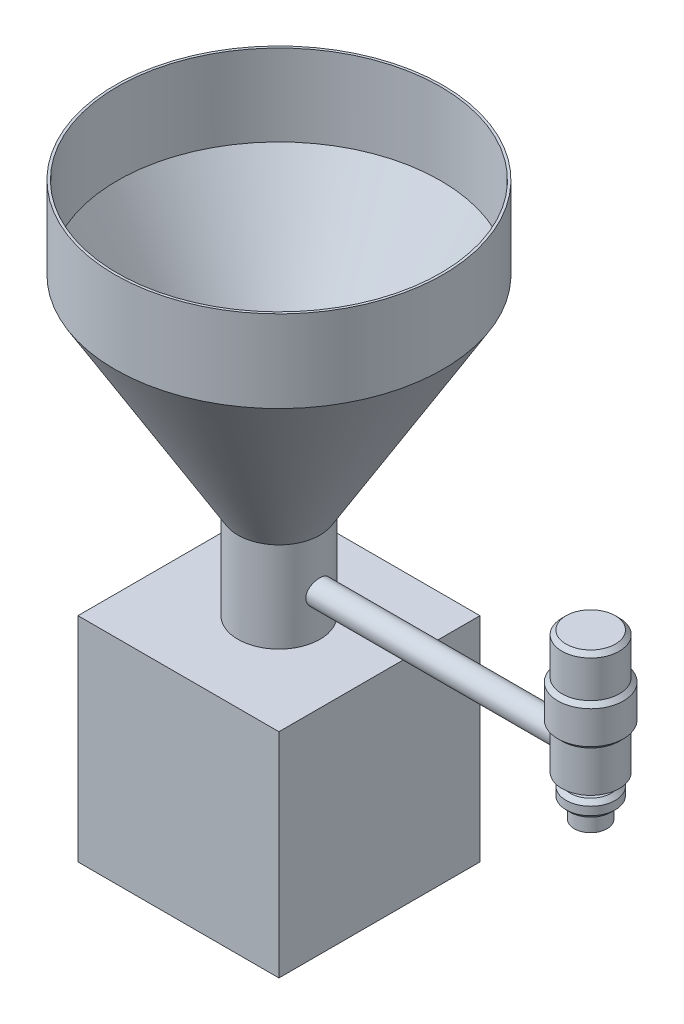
ISO-10303-21;
HEADER;
FILE_DESCRIPTION(('STEP AP214'),'2;1');
FILE_NAME('part.step','',(''),(''),'','','');
FILE_SCHEMA(('AUTOMOTIVE_DESIGN { 1 0 10303 214 1 1 1 1 }'));
ENDSEC;
DATA;
#1=APPLICATION_CONTEXT('core data for automotive mechanical design processes');
#2=APPLICATION_PROTOCOL_DEFINITION('international standard','automotive_design',2000,#1);
#3=PRODUCT_CONTEXT('',#1,'mechanical');
#4=PRODUCT('Part','Part','',(#3));
#5=PRODUCT_RELATED_PRODUCT_CATEGORY('part','',(#4));
#6=PRODUCT_DEFINITION_FORMATION('','',#4);
#7=PRODUCT_DEFINITION_CONTEXT('part definition',#1,'design');
#8=PRODUCT_DEFINITION('design','',#6,#7);
#9=PRODUCT_DEFINITION_SHAPE('','',#8);
#10=(LENGTH_UNIT() NAMED_UNIT(*) SI_UNIT(.MILLI.,.METRE.));
#11=(NAMED_UNIT(*) PLANE_ANGLE_UNIT() SI_UNIT($,.RADIAN.));
#12=(NAMED_UNIT(*) SI_UNIT($,.STERADIAN.) SOLID_ANGLE_UNIT());
#13=UNCERTAINTY_MEASURE_WITH_UNIT(LENGTH_MEASURE(1.E-05),#10,'distance_accuracy_value','');
#14=(GEOMETRIC_REPRESENTATION_CONTEXT(3) GLOBAL_UNCERTAINTY_ASSIGNED_CONTEXT((#13)) GLOBAL_UNIT_ASSIGNED_CONTEXT((#10,
#11,#12)) REPRESENTATION_CONTEXT('',''));
#15=CARTESIAN_POINT('',(0.,0.,0.));
#16=DIRECTION('',(0.,0.,1.));
#17=DIRECTION('',(1.,0.,0.));
#18=AXIS2_PLACEMENT_3D('',#15,#16,#17);
#19=CARTESIAN_POINT('',(-380.,75.,0.));
#20=DIRECTION('',(1.,0.,0.));
#21=DIRECTION('',(0.,0.,-1.));
#22=AXIS2_PLACEMENT_3D('',#19,#20,#21);
#23=CYLINDRICAL_SURFACE('',#22,15.);
#24=CARTESIAN_POINT('',(-31.6227766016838,75.,-15.));
#25=CARTESIAN_POINT('',(-31.6227798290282,75.3990011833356,-14.9999969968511));
#26=CARTESIAN_POINT('',(-31.6303543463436,75.7981304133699,-14.9840568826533));
#27=CARTESIAN_POINT('',(-31.660401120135,76.5934647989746,-14.9204623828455));
#28=CARTESIAN_POINT('',(-31.6828827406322,76.9896679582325,-14.8727880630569));
#29=CARTESIAN_POINT('',(-31.7420366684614,77.7769244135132,-14.7461180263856));
#30=CARTESIAN_POINT('',(-31.7787422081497,78.1679634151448,-14.667048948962));
#31=CARTESIAN_POINT('',(-31.8650992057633,78.9410836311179,-14.47847300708));
#32=CARTESIAN_POINT('',(-31.9147487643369,79.3231661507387,-14.3689706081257));
#33=CARTESIAN_POINT('',(-32.025171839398,80.0743574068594,-14.121142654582));
#34=CARTESIAN_POINT('',(-32.0858972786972,80.4435142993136,-13.9829413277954));
#35=CARTESIAN_POINT('',(-32.2167980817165,81.1684033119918,-13.6786452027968));
#36=CARTESIAN_POINT('',(-32.2869737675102,81.5241349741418,-13.5125494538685));
#37=CARTESIAN_POINT('',(-32.4347713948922,82.2201109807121,-13.1538283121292));
#38=CARTESIAN_POINT('',(-32.5123898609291,82.5603624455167,-12.9612152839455));
#39=CARTESIAN_POINT('',(-32.6730849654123,83.2240009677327,-12.5506225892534));
#40=CARTESIAN_POINT('',(-32.7561635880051,83.5473818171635,-12.332633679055));
#41=CARTESIAN_POINT('',(-32.9307449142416,84.1943845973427,-11.8588991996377));
#42=CARTESIAN_POINT('',(-33.022454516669,84.5168704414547,-11.6016771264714));
#43=CARTESIAN_POINT('',(-33.2072063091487,85.1393747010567,-11.0617742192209));
#44=CARTESIAN_POINT('',(-33.3002485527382,85.4393922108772,-10.779092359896));
#45=CARTESIAN_POINT('',(-33.4853156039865,86.0154808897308,-10.189656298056));
#46=CARTESIAN_POINT('',(-33.5773398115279,86.2915385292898,-9.88288867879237));
#47=CARTESIAN_POINT('',(-33.7579502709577,86.8177948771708,-9.24715861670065));
#48=CARTESIAN_POINT('',(-33.846537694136,87.0680024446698,-8.91820384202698));
#49=CARTESIAN_POINT('',(-34.0220726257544,87.5520782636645,-8.223907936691));
#50=CARTESIAN_POINT('',(-34.1087507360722,87.7846393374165,-7.85758519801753));
#51=CARTESIAN_POINT('',(-34.2734912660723,88.2178801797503,-7.10466659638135));
#52=CARTESIAN_POINT('',(-34.3515533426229,88.4185586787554,-6.71806992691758));
#53=CARTESIAN_POINT('',(-34.4967887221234,88.7861138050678,-5.92731639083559));
#54=CARTESIAN_POINT('',(-34.5639659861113,88.9530027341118,-5.52316598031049));
#55=CARTESIAN_POINT('',(-34.6854707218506,89.2513317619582,-4.70011703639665));
#56=CARTESIAN_POINT('',(-34.739799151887,89.3827745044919,-4.2812196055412));
#57=CARTESIAN_POINT('',(-34.8313748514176,89.60253703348,-3.4552066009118));
#58=CARTESIAN_POINT('',(-34.8693935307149,89.6928213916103,-3.0486987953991));
#59=CARTESIAN_POINT('',(-34.9314000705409,89.8393777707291,-2.22853652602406));
#60=CARTESIAN_POINT('',(-34.9553883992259,89.8956509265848,-1.8148823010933));
#61=CARTESIAN_POINT('',(-34.9886385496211,89.9735121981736,-0.983884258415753));
#62=CARTESIAN_POINT('',(-34.9979057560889,89.9951129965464,-0.566541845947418));
#63=CARTESIAN_POINT('',(-35.0014599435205,90.0034069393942,0.268545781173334));
#64=CARTESIAN_POINT('',(-34.9957475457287,89.9901015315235,0.686290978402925));
#65=CARTESIAN_POINT('',(-34.9703596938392,89.9307301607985,1.49190758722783));
#66=CARTESIAN_POINT('',(-34.9516073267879,89.8868295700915,1.87997004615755));
#67=CARTESIAN_POINT('',(-34.9016183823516,89.7690828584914,2.65068752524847));
#68=CARTESIAN_POINT('',(-34.8703824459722,89.6952382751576,3.03334282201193));
#69=CARTESIAN_POINT('',(-34.7962000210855,89.5183324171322,3.79067999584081));
#70=CARTESIAN_POINT('',(-34.7532531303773,89.4152701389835,4.16536159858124));
#71=CARTESIAN_POINT('',(-34.656689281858,89.180885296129,4.90436245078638));
#72=CARTESIAN_POINT('',(-34.6030719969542,89.0495618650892,5.26868138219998));
#73=CARTESIAN_POINT('',(-34.4855410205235,88.7575676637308,5.99025205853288));
#74=CARTESIAN_POINT('',(-34.4214828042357,88.5964799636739,6.34731135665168));
#75=CARTESIAN_POINT('',(-34.2851820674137,88.2476217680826,7.04650073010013));
#76=CARTESIAN_POINT('',(-34.212939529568,88.0598512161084,7.38863077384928));
#77=CARTESIAN_POINT('',(-34.0619212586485,87.6589476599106,8.05621899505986));
#78=CARTESIAN_POINT('',(-33.9831448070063,87.4458118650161,8.38167533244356));
#79=CARTESIAN_POINT('',(-33.8208111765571,86.9954738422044,9.01440333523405));
#80=CARTESIAN_POINT('',(-33.7372521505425,86.7582622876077,9.32166787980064));
#81=CARTESIAN_POINT('',(-33.5609647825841,86.2428311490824,9.93840787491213));
#82=CARTESIAN_POINT('',(-33.4680149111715,85.9628770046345,10.2463720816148));
#83=CARTESIAN_POINT('',(-33.2811817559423,85.3785206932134,10.8378576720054));
#84=CARTESIAN_POINT('',(-33.1872984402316,85.0741176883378,11.1213782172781));
#85=CARTESIAN_POINT('',(-33.0010372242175,84.4424336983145,11.6624805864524));
#86=CARTESIAN_POINT('',(-32.9086598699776,84.1151446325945,11.9200531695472));
#87=CARTESIAN_POINT('',(-32.7279529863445,83.4394828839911,12.4076070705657));
#88=CARTESIAN_POINT('',(-32.6396240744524,83.0911070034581,12.6375841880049));
#89=CARTESIAN_POINT('',(-32.4664341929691,82.3620151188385,13.0762496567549));
#90=CARTESIAN_POINT('',(-32.3818200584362,81.9805810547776,13.2838446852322));
#91=CARTESIAN_POINT('',(-32.2224967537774,81.1996219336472,13.6657796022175));
#92=CARTESIAN_POINT('',(-32.1477831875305,80.8001050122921,13.840134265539));
#93=CARTESIAN_POINT('',(-32.0108701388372,79.9856632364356,14.1539223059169));
#94=CARTESIAN_POINT('',(-31.9486658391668,79.5707443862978,14.2933691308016));
#95=CARTESIAN_POINT('',(-31.8390857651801,78.7284877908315,14.53583039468));
#96=CARTESIAN_POINT('',(-31.7917085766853,78.3011512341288,14.6388483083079));
#97=CARTESIAN_POINT('',(-31.7163058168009,77.4667538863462,14.8014667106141));
#98=CARTESIAN_POINT('',(-31.6871903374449,77.0602701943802,14.8635274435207));
#99=CARTESIAN_POINT('',(-31.6445557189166,76.2427675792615,14.9540838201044));
#100=CARTESIAN_POINT('',(-31.6310358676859,75.8317488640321,14.9825809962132));
#101=CARTESIAN_POINT('',(-31.620101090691,75.0086834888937,15.0056445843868));
#102=CARTESIAN_POINT('',(-31.6226808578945,74.5966372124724,15.0002221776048));
#103=CARTESIAN_POINT('',(-31.6438362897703,73.7748076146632,14.9555420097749));
#104=CARTESIAN_POINT('',(-31.6624114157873,73.365024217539,14.9162853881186));
#105=CARTESIAN_POINT('',(-31.7130331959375,72.5793913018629,14.8083348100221));
#106=CARTESIAN_POINT('',(-31.7440524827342,72.2031647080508,14.7418793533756));
#107=CARTESIAN_POINT('',(-31.8183589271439,71.4580543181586,14.5808056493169));
#108=CARTESIAN_POINT('',(-31.8616453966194,71.0891701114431,14.486188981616));
#109=CARTESIAN_POINT('',(-31.9591944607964,70.3609994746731,14.2696869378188));
#110=CARTESIAN_POINT('',(-32.0134570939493,70.0017130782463,14.1478014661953));
#111=CARTESIAN_POINT('',(-32.1314455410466,69.2946177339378,13.8777487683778));
#112=CARTESIAN_POINT('',(-32.1951750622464,68.9468133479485,13.7295712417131));
#113=CARTESIAN_POINT('',(-32.3332965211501,68.2499115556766,13.4011569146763));
#114=CARTESIAN_POINT('',(-32.4080293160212,67.9014027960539,13.2198147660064));
#115=CARTESIAN_POINT('',(-32.563925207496,67.2205975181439,12.8310033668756));
#116=CARTESIAN_POINT('',(-32.6450911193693,66.8883082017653,12.6235226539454));
#117=CARTESIAN_POINT('',(-32.811754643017,66.2416397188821,12.183761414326));
#118=CARTESIAN_POINT('',(-32.8972529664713,65.9272635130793,11.9514768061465));
#119=CARTESIAN_POINT('',(-33.0704829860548,65.3179454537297,11.4634289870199));
#120=CARTESIAN_POINT('',(-33.1582147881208,65.0230045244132,11.2076646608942));
#121=CARTESIAN_POINT('',(-33.3415278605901,64.4290920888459,10.6506249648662));
#122=CARTESIAN_POINT('',(-33.4371252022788,64.1320200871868,10.3473256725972));
#123=CARTESIAN_POINT('',(-33.6259000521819,63.5644071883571,9.71633909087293));
#124=CARTESIAN_POINT('',(-33.7190783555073,63.293857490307,9.38865995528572));
#125=CARTESIAN_POINT('',(-33.9005859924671,62.7808628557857,8.71053874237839));
#126=CARTESIAN_POINT('',(-33.9889137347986,62.5384271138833,8.36008927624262));
#127=CARTESIAN_POINT('',(-34.1583045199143,62.0835635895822,7.6385557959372));
#128=CARTESIAN_POINT('',(-34.2393677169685,61.8711351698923,7.26747222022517));
#129=CARTESIAN_POINT('',(-34.392388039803,61.4770750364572,6.5050404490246));
#130=CARTESIAN_POINT('',(-34.4642975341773,61.2956028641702,6.113600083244));
#131=CARTESIAN_POINT('',(-34.5964819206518,60.9664942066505,5.31481805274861));
#132=CARTESIAN_POINT('',(-34.6567566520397,60.8188581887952,4.90747616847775));
#133=CARTESIAN_POINT('',(-34.7638668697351,60.5590704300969,4.0801280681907));
#134=CARTESIAN_POINT('',(-34.8107093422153,60.4469002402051,3.66012856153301));
#135=CARTESIAN_POINT('',(-34.8895705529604,60.2592605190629,2.81065056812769));
#136=CARTESIAN_POINT('',(-34.9215904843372,60.1837880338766,2.38117284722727));
#137=CARTESIAN_POINT('',(-34.9680494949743,60.0746283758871,1.54810458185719));
#138=CARTESIAN_POINT('',(-34.9836045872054,60.0382853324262,1.14492225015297));
#139=CARTESIAN_POINT('',(-35.0007146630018,59.9983213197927,0.336650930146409));
#140=CARTESIAN_POINT('',(-35.0022703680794,59.9946986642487,-0.0684379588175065));
#141=CARTESIAN_POINT('',(-34.9913404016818,60.0202125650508,-0.877316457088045));
#142=CARTESIAN_POINT('',(-34.9788571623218,60.0493434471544,-1.28110627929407));
#143=CARTESIAN_POINT('',(-34.9401934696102,60.1400268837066,-2.08435932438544));
#144=CARTESIAN_POINT('',(-34.9140131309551,60.2015791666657,-2.48382258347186));
#145=CARTESIAN_POINT('',(-34.8499444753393,60.3533908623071,-3.25990951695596));
#146=CARTESIAN_POINT('',(-34.812555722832,60.4424294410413,-3.63681443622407));
#147=CARTESIAN_POINT('',(-34.7266976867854,60.6489599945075,-4.38142946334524));
#148=CARTESIAN_POINT('',(-34.6782287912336,60.7664509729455,-4.74913989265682));
#149=CARTESIAN_POINT('',(-34.5713495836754,61.0288667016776,-5.47318347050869));
#150=CARTESIAN_POINT('',(-34.5129380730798,61.1737947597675,-5.82951524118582));
#151=CARTESIAN_POINT('',(-34.3875190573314,61.4899108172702,-6.52876162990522));
#152=CARTESIAN_POINT('',(-34.3205111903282,61.6610999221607,-6.87167568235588));
#153=CARTESIAN_POINT('',(-34.1761780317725,62.0368755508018,-7.55759351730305));
#154=CARTESIAN_POINT('',(-34.0985215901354,62.2426290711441,-7.89988828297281));
#155=CARTESIAN_POINT('',(-33.9373019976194,62.6800247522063,-8.56603740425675));
#156=CARTESIAN_POINT('',(-33.8537387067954,62.91166752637,-8.88989132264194));
#157=CARTESIAN_POINT('',(-33.6826610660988,63.3994048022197,-9.51757199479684));
#158=CARTESIAN_POINT('',(-33.5951462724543,63.6555020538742,-9.82139648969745));
#159=CARTESIAN_POINT('',(-33.4181862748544,64.1907908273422,-10.4076237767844));
#160=CARTESIAN_POINT('',(-33.3287401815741,64.4699931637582,-10.690016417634));
#161=CARTESIAN_POINT('',(-33.1435737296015,65.0710499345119,-11.2515403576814));
#162=CARTESIAN_POINT('',(-33.0478701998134,65.3945295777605,-11.5289405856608));
#163=CARTESIAN_POINT('',(-32.8594501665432,66.0643033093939,-12.0554848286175));
#164=CARTESIAN_POINT('',(-32.7667324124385,66.4105876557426,-12.3046407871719));
#165=CARTESIAN_POINT('',(-32.586872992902,67.1244878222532,-12.7733627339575));
#166=CARTESIAN_POINT('',(-32.4997363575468,67.4921223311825,-12.9929022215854));
#167=CARTESIAN_POINT('',(-32.3338425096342,68.2462876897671,-13.4004122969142));
#168=CARTESIAN_POINT('',(-32.2550847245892,68.6328172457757,-13.5883850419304));
#169=CARTESIAN_POINT('',(-32.1086866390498,69.4216787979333,-13.9307889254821));
#170=CARTESIAN_POINT('',(-32.0410269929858,69.8239817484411,-14.0852785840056));
#171=CARTESIAN_POINT('',(-31.9190482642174,70.6423292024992,-14.3595587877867));
#172=CARTESIAN_POINT('',(-31.8647315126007,71.0583760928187,-14.4793432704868));
#173=CARTESIAN_POINT('',(-31.7716530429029,71.8996468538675,-14.6824564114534));
#174=CARTESIAN_POINT('',(-31.7328452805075,72.3248395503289,-14.7658930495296));
#175=CARTESIAN_POINT('',(-31.6721241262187,73.1818158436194,-14.8956958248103));
#176=CARTESIAN_POINT('',(-31.6501977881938,73.6135941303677,-14.9420903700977));
#177=CARTESIAN_POINT('',(-31.6323614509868,74.2053067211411,-14.9797789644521));
#178=CARTESIAN_POINT('',(-31.6287699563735,74.36412090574,-14.9873593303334));
#179=CARTESIAN_POINT('',(-31.6239768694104,74.6819499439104,-14.9974704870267));
#180=CARTESIAN_POINT('',(-31.6227753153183,74.8409648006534,-15.0000011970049));
#181=CARTESIAN_POINT('',(-31.6227766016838,75.,-15.));
#182=B_SPLINE_CURVE_WITH_KNOTS('',3,(#24,#25,#26,#27,#28,#29,#30,#31,#32,#33,#34,#35,#36,#37,
#38,#39,#40,#41,#42,#43,#44,#45,#46,#47,#48,#49,#50,#51,#52,#53,#54,#55,#56,#57,#58,#59,#60,#61,
#62,#63,#64,#65,#66,#67,#68,#69,#70,#71,#72,#73,#74,#75,#76,#77,#78,#79,#80,#81,#82,#83,#84,#85,
#86,#87,#88,#89,#90,#91,#92,#93,#94,#95,#96,#97,#98,#99,#100,#101,#102,#103,#104,#105,#106,#107,
#108,#109,#110,#111,#112,#113,#114,#115,#116,#117,#118,#119,#120,#121,#122,#123,#124,#125,#126,
#127,#128,#129,#130,#131,#132,#133,#134,#135,#136,#137,#138,#139,#140,#141,#142,#143,#144,#145,
#146,#147,#148,#149,#150,#151,#152,#153,#154,#155,#156,#157,#158,#159,#160,#161,#162,#163,#164,
#165,#166,#167,#168,#169,#170,#171,#172,#173,#174,#175,#176,#177,#178,#179,#180,#181),
.UNSPECIFIED.,.T.,.F.,(4,2,2,2,2,2,2,2,2,2,2,2,2,2,2,2,2,2,2,2,2,2,2,2,2,2,2,2,2,2,2,2,2,2,2,2,
2,2,2,2,2,2,2,2,2,2,2,2,2,2,2,2,2,2,2,2,2,2,2,2,2,2,2,2,2,2,2,2,2,2,2,2,2,2,2,2,2,2,4),(0.,
1.19683825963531,2.39442903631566,3.59483486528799,4.79506465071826,5.990203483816,
7.18538305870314,8.38000721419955,9.57506790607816,10.8414089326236,12.1078009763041,
13.3749035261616,14.6415703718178,15.9673413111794,17.2931650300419,18.6185051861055,
19.9437464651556,21.1965415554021,22.4492948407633,23.7015897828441,24.9538327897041,
26.1254164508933,27.2969399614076,28.4685037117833,29.6401033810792,30.8295664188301,
32.0190319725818,33.2086285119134,34.3986876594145,35.6765982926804,36.9545527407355,
38.2329607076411,39.5115630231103,40.8371660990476,42.1621785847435,43.4866798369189,
44.8110547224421,46.0460817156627,47.2810523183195,48.5156158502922,49.7501378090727,
50.8987548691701,52.047307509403,53.1958641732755,54.3448718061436,55.5433331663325,
56.7423219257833,57.9415082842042,59.1407516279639,60.4447784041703,61.7483709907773,
63.0523887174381,64.3563787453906,65.6668985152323,66.9774363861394,68.2872913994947,
69.5970409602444,70.8108492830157,72.0245950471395,73.238130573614,74.4516559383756,
75.6175774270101,76.783458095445,77.949479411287,79.1155498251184,80.3347955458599,
81.5540701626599,82.7734820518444,83.9934679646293,85.3021866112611,86.6103497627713,
87.9196757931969,89.228912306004,90.5358418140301,91.8429994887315,93.1462470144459,
94.4484940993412,94.9255261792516,95.4025658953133),.UNSPECIFIED.);
#183=CARTESIAN_POINT('',(-31.6227766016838,75.,-15.));
#184=VERTEX_POINT('',#183);
#185=EDGE_CURVE('E220',#184,#184,#182,.T.);
#186=ORIENTED_EDGE('',*,*,#185,.F.);
#187=EDGE_LOOP('',(#186));
#188=FACE_BOUND('',#187,.T.);
#189=CARTESIAN_POINT('',(-332.303039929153,75.,-15.));
#190=CARTESIAN_POINT('',(-332.303039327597,75.4109888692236,-14.9999991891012));
#191=CARTESIAN_POINT('',(-332.297713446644,75.8219918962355,-14.9830945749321));
#192=CARTESIAN_POINT('',(-332.276576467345,76.6409627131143,-14.9156320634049));
#193=CARTESIAN_POINT('',(-332.260764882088,77.0489303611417,-14.86507260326));
#194=CARTESIAN_POINT('',(-332.219146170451,77.8589604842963,-14.730748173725));
#195=CARTESIAN_POINT('',(-332.193336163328,78.2610212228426,-14.6469736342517));
#196=CARTESIAN_POINT('',(-332.132515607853,79.056262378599,-14.4469666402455));
#197=CARTESIAN_POINT('',(-332.097505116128,79.4494428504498,-14.3307343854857));
#198=CARTESIAN_POINT('',(-332.019401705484,80.223589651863,-14.0670197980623));
#199=CARTESIAN_POINT('',(-331.976322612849,80.6045755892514,-13.9195908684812));
#200=CARTESIAN_POINT('',(-331.883295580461,81.3525567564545,-13.5945325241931));
#201=CARTESIAN_POINT('',(-331.833347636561,81.719551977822,-13.4169030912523));
#202=CARTESIAN_POINT('',(-331.727985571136,82.4372998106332,-13.0327386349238));
#203=CARTESIAN_POINT('',(-331.672570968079,82.7880509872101,-12.8262010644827));
#204=CARTESIAN_POINT('',(-331.557791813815,83.4711829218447,-12.3856475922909));
#205=CARTESIAN_POINT('',(-331.498427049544,83.803562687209,-12.1516302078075));
#206=CARTESIAN_POINT('',(-331.375592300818,84.45722043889,-11.650553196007));
#207=CARTESIAN_POINT('',(-331.312053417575,84.7779070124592,-11.3827386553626));
#208=CARTESIAN_POINT('',(-331.184219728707,85.3957577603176,-10.8213882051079));
#209=CARTESIAN_POINT('',(-331.119924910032,85.6929215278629,-10.5278518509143));
#210=CARTESIAN_POINT('',(-330.992315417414,86.2618841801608,-9.91686644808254));
#211=CARTESIAN_POINT('',(-330.929000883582,86.5336794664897,-9.59941401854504));
#212=CARTESIAN_POINT('',(-330.805069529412,87.050063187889,-8.94262153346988));
#213=CARTESIAN_POINT('',(-330.744452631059,87.2946524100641,-8.60328211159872));
#214=CARTESIAN_POINT('',(-330.626333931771,87.7597237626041,-7.89757572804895));
#215=CARTESIAN_POINT('',(-330.56892288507,87.9796002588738,-7.53079401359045));
#216=CARTESIAN_POINT('',(-330.460234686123,88.3875696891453,-6.77907492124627));
#217=CARTESIAN_POINT('',(-330.408957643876,88.5756620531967,-6.39413721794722));
#218=CARTESIAN_POINT('',(-330.314013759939,88.9184901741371,-5.6088454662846));
#219=CARTESIAN_POINT('',(-330.27034565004,89.0732314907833,-5.20849400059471));
#220=CARTESIAN_POINT('',(-330.191879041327,89.3480407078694,-4.3952181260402));
#221=CARTESIAN_POINT('',(-330.157080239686,89.468109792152,-3.98229414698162));
#222=CARTESIAN_POINT('',(-330.098230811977,89.6695459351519,-3.15893611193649));
#223=CARTESIAN_POINT('',(-330.073901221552,89.7519217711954,-2.74876867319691));
#224=CARTESIAN_POINT('',(-330.035263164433,89.8821640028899,-1.92252240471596));
#225=CARTESIAN_POINT('',(-330.020954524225,89.9300309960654,-1.50644367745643));
#226=CARTESIAN_POINT('',(-330.00276742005,89.9908007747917,-0.671588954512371));
#227=CARTESIAN_POINT('',(-329.998887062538,90.0037099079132,-0.252813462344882));
#228=CARTESIAN_POINT('',(-330.001662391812,89.9944585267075,0.584310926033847));
#229=CARTESIAN_POINT('',(-330.008317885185,89.9722986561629,1.00265982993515));
#230=CARTESIAN_POINT('',(-330.031595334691,89.8943876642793,1.82244642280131));
#231=CARTESIAN_POINT('',(-330.047892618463,89.8397305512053,2.22399789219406));
#232=CARTESIAN_POINT('',(-330.089746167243,89.6982312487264,3.02088653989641));
#233=CARTESIAN_POINT('',(-330.115302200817,89.6113898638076,3.41622387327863));
#234=CARTESIAN_POINT('',(-330.175000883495,89.406254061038,4.19799578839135));
#235=CARTESIAN_POINT('',(-330.209143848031,89.2879584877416,4.58443004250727));
#236=CARTESIAN_POINT('',(-330.285128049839,89.0208727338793,5.34583052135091));
#237=CARTESIAN_POINT('',(-330.326969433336,88.8720819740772,5.72079652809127));
#238=CARTESIAN_POINT('',(-330.417802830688,88.5432465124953,6.46114855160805));
#239=CARTESIAN_POINT('',(-330.466872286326,88.3628587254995,6.82637261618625));
#240=CARTESIAN_POINT('',(-330.57052227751,87.9733762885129,7.54035022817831));
#241=CARTESIAN_POINT('',(-330.625102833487,87.7642815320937,7.88910371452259));
#242=CARTESIAN_POINT('',(-330.738389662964,87.3187926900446,8.56809494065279));
#243=CARTESIAN_POINT('',(-330.797096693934,87.0823935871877,8.89832926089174));
#244=CARTESIAN_POINT('',(-330.917137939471,86.5838624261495,9.53827363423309));
#245=CARTESIAN_POINT('',(-330.978472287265,86.321729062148,9.84798264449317));
#246=CARTESIAN_POINT('',(-331.104596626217,85.7627790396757,10.4565672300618));
#247=CARTESIAN_POINT('',(-331.169428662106,85.4650146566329,10.7545643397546));
#248=CARTESIAN_POINT('',(-331.298457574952,84.8454066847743,11.3245385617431));
#249=CARTESIAN_POINT('',(-331.362654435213,84.5235624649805,11.596514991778));
#250=CARTESIAN_POINT('',(-331.488623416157,83.8577926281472,12.1126770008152));
#251=CARTESIAN_POINT('',(-331.55039523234,83.513864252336,12.3568590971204));
#252=CARTESIAN_POINT('',(-331.669735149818,82.8061591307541,12.8156822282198));
#253=CARTESIAN_POINT('',(-331.727303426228,82.4423832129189,13.0303244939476));
#254=CARTESIAN_POINT('',(-331.837073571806,81.6937193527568,13.4304128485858));
#255=CARTESIAN_POINT('',(-331.889218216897,81.3086613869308,13.6155568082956));
#256=CARTESIAN_POINT('',(-331.985884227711,80.5233261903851,13.9526145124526));
#257=CARTESIAN_POINT('',(-332.030405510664,80.1230487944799,14.1045278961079));
#258=CARTESIAN_POINT('',(-332.110389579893,79.3102521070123,14.3737591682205));
#259=CARTESIAN_POINT('',(-332.145854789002,78.8977361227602,14.4910863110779));
#260=CARTESIAN_POINT('',(-332.206572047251,78.0634600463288,14.6901019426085));
#261=CARTESIAN_POINT('',(-332.231824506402,77.6417003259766,14.7717918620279));
#262=CARTESIAN_POINT('',(-332.270530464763,76.8080698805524,14.8963695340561));
#263=CARTESIAN_POINT('',(-332.284388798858,76.3964167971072,14.9405905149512));
#264=CARTESIAN_POINT('',(-332.301412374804,75.5706464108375,14.9948510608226));
#265=CARTESIAN_POINT('',(-332.304577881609,75.1565291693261,15.0048914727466));
#266=CARTESIAN_POINT('',(-332.300114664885,74.3289961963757,14.990696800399));
#267=CARTESIAN_POINT('',(-332.292487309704,73.9155803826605,14.9664660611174));
#268=CARTESIAN_POINT('',(-332.266684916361,73.0924961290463,14.8839676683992));
#269=CARTESIAN_POINT('',(-332.248509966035,72.6828276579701,14.8257002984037));
#270=CARTESIAN_POINT('',(-332.202792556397,71.8808409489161,14.6776285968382));
#271=CARTESIAN_POINT('',(-332.175506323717,71.4883486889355,14.588684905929));
#272=CARTESIAN_POINT('',(-332.112280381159,70.7124350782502,14.3797846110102));
#273=CARTESIAN_POINT('',(-332.076340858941,70.3290135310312,14.2598286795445));
#274=CARTESIAN_POINT('',(-331.996835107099,69.5736814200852,13.989851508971));
#275=CARTESIAN_POINT('',(-331.953268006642,69.2017721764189,13.8398268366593));
#276=CARTESIAN_POINT('',(-331.859724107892,68.47181366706,13.5108498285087));
#277=CARTESIAN_POINT('',(-331.809747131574,68.1137647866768,13.3318966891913));
#278=CARTESIAN_POINT('',(-331.703325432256,67.4042721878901,12.9411477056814));
#279=CARTESIAN_POINT('',(-331.646743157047,67.0532634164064,12.728599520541));
#280=CARTESIAN_POINT('',(-331.529811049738,66.3702576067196,12.275806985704));
#281=CARTESIAN_POINT('',(-331.469461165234,66.0382608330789,12.0355622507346));
#282=CARTESIAN_POINT('',(-331.346607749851,65.3951977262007,11.5288927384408));
#283=CARTESIAN_POINT('',(-331.284103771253,65.0841357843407,11.2624624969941));
#284=CARTESIAN_POINT('',(-331.158604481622,64.4848786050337,10.7051233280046));
#285=CARTESIAN_POINT('',(-331.095609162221,64.1966837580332,10.4142139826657));
#286=CARTESIAN_POINT('',(-330.968407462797,63.6344880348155,9.79823995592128));
#287=CARTESIAN_POINT('',(-330.904245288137,63.3614352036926,9.47229995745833));
#288=CARTESIAN_POINT('',(-330.778947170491,62.84371986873,8.79804089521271));
#289=CARTESIAN_POINT('',(-330.717811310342,62.5990581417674,8.44972121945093));
#290=CARTESIAN_POINT('',(-330.600274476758,62.1399008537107,7.73297964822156));
#291=CARTESIAN_POINT('',(-330.543873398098,61.9254046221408,7.36455819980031));
#292=CARTESIAN_POINT('',(-330.437392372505,61.5282259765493,6.61007136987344));
#293=CARTESIAN_POINT('',(-330.38731230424,61.3455429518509,6.22400632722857));
#294=CARTESIAN_POINT('',(-330.295250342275,61.0147507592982,5.43989725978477));
#295=CARTESIAN_POINT('',(-330.253209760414,60.8663892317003,5.04196665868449));
#296=CARTESIAN_POINT('',(-330.177955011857,60.6037501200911,4.23418833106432));
#297=CARTESIAN_POINT('',(-330.144740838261,60.4894725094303,3.82434061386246));
#298=CARTESIAN_POINT('',(-330.088106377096,60.2960657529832,2.99586652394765));
#299=CARTESIAN_POINT('',(-330.064683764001,60.2169282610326,2.57724226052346));
#300=CARTESIAN_POINT('',(-330.028308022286,60.0945168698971,1.73433631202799));
#301=CARTESIAN_POINT('',(-330.015354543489,60.0512417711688,1.31005481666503));
#302=CARTESIAN_POINT('',(-330.000587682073,60.0019418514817,0.475570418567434));
#303=CARTESIAN_POINT('',(-329.99836416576,59.9945455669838,0.0654551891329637));
#304=CARTESIAN_POINT('',(-330.004005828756,60.0133553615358,-0.753926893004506));
#305=CARTESIAN_POINT('',(-330.011870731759,60.0395605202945,-1.1631937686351));
#306=CARTESIAN_POINT('',(-330.037472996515,60.1253311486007,-1.97787465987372));
#307=CARTESIAN_POINT('',(-330.055209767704,60.1848946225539,-2.38328890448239));
#308=CARTESIAN_POINT('',(-330.100072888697,60.3368492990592,-3.18738597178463));
#309=CARTESIAN_POINT('',(-330.127199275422,60.4292406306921,-3.58606876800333));
#310=CARTESIAN_POINT('',(-330.189771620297,60.644883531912,-4.36966666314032));
#311=CARTESIAN_POINT('',(-330.225124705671,60.7677915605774,-4.75468386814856));
#312=CARTESIAN_POINT('',(-330.30338508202,61.0439597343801,-5.51286866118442));
#313=CARTESIAN_POINT('',(-330.346292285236,61.1972195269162,-5.88603638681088));
#314=CARTESIAN_POINT('',(-330.438568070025,61.5329448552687,-6.61820550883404));
#315=CARTESIAN_POINT('',(-330.48793736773,61.7154136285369,-6.97720532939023));
#316=CARTESIAN_POINT('',(-330.591888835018,62.1082462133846,-7.67882469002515));
#317=CARTESIAN_POINT('',(-330.646471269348,62.3186114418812,-8.02144339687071));
#318=CARTESIAN_POINT('',(-330.761293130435,62.7729769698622,-8.69893927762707));
#319=CARTESIAN_POINT('',(-330.82165766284,63.017837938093,-9.03321823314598));
#320=CARTESIAN_POINT('',(-330.944889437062,63.5341073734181,-9.68011207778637));
#321=CARTESIAN_POINT('',(-331.007756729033,63.8055163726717,-9.99272653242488));
#322=CARTESIAN_POINT('',(-331.134333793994,64.3731535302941,-10.5943945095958));
#323=CARTESIAN_POINT('',(-331.198043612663,64.6693830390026,-10.883446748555));
#324=CARTESIAN_POINT('',(-331.324630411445,65.2849421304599,-11.4362960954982));
#325=CARTESIAN_POINT('',(-331.387507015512,65.6042817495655,-11.7000821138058));
#326=CARTESIAN_POINT('',(-331.512536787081,66.273864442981,-12.208045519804));
#327=CARTESIAN_POINT('',(-331.574612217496,66.6247457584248,-12.4514016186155));
#328=CARTESIAN_POINT('',(-331.694189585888,67.3463832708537,-12.9075276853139));
#329=CARTESIAN_POINT('',(-331.751693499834,67.7171307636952,-13.1203109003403));
#330=CARTESIAN_POINT('',(-331.860409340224,68.4761057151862,-13.5137515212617));
#331=CARTESIAN_POINT('',(-331.911622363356,68.8643301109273,-13.6944145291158));
#332=CARTESIAN_POINT('',(-332.006164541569,69.6556144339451,-14.0221568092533));
#333=CARTESIAN_POINT('',(-332.049494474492,70.058672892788,-14.1692393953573));
#334=CARTESIAN_POINT('',(-332.122700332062,70.8325308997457,-14.4145316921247));
#335=CARTESIAN_POINT('',(-332.153523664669,71.2021161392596,-14.5163031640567));
#336=CARTESIAN_POINT('',(-332.206979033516,71.9485449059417,-14.691342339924));
#337=CARTESIAN_POINT('',(-332.229611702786,72.3253878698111,-14.7646122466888));
#338=CARTESIAN_POINT('',(-332.266072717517,73.0839374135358,-14.8820689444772));
#339=CARTESIAN_POINT('',(-332.279902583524,73.4656431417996,-14.9262607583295));
#340=CARTESIAN_POINT('',(-332.298386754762,74.2315616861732,-14.9852275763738));
#341=CARTESIAN_POINT('',(-332.303040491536,74.6157746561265,-15.0000007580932));
#342=CARTESIAN_POINT('',(-332.303039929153,75.,-15.));
#343=B_SPLINE_CURVE_WITH_KNOTS('',3,(#189,#190,#191,#192,#193,#194,#195,#196,#197,#198,#199,
#200,#201,#202,#203,#204,#205,#206,#207,#208,#209,#210,#211,#212,#213,#214,#215,#216,#217,#218,
#219,#220,#221,#222,#223,#224,#225,#226,#227,#228,#229,#230,#231,#232,#233,#234,#235,#236,#237,
#238,#239,#240,#241,#242,#243,#244,#245,#246,#247,#248,#249,#250,#251,#252,#253,#254,#255,#256,
#257,#258,#259,#260,#261,#262,#263,#264,#265,#266,#267,#268,#269,#270,#271,#272,#273,#274,#275,
#276,#277,#278,#279,#280,#281,#282,#283,#284,#285,#286,#287,#288,#289,#290,#291,#292,#293,#294,
#295,#296,#297,#298,#299,#300,#301,#302,#303,#304,#305,#306,#307,#308,#309,#310,#311,#312,#313,
#314,#315,#316,#317,#318,#319,#320,#321,#322,#323,#324,#325,#326,#327,#328,#329,#330,#331,#332,
#333,#334,#335,#336,#337,#338,#339,#340,#341,#342),.UNSPECIFIED.,.T.,.F.,(4,2,2,2,2,2,2,2,2,2,2,
2,2,2,2,2,2,2,2,2,2,2,2,2,2,2,2,2,2,2,2,2,2,2,2,2,2,2,2,2,2,2,2,2,2,2,2,2,2,2,2,2,2,2,2,2,2,2,2,
2,2,2,2,2,2,2,2,2,2,2,2,2,2,2,2,2,4),(0.,1.23261087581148,2.46527899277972,3.69830253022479,
4.93131847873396,6.16224055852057,7.39316338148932,8.62419472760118,9.8552925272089,
11.1216825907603,12.3880945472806,13.654685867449,14.9212405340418,16.2140799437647,
17.5069425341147,18.7995894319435,20.0921921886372,21.3478219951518,22.603430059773,
23.8588101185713,25.1141671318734,26.3294819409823,27.54476637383,28.7600954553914,
29.9754476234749,31.2049223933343,32.4344017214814,33.6641073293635,34.8938753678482,
36.1710714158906,37.4483009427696,38.7256903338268,40.0030264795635,41.2927041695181,
42.5823958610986,43.8717421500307,45.1610366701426,46.4022577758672,47.6434481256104,
48.8844811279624,50.1255037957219,51.3342135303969,52.5428970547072,53.7517186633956,
54.9605738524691,56.2018621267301,57.4431676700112,58.6847327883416,59.926319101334,
61.2148280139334,62.5033721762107,63.7918876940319,65.0803784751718,66.3590706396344,
67.6377618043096,68.9161491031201,70.1944936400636,71.4235664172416,72.6526055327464,
73.8815711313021,75.1105415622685,76.3262587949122,77.5419619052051,78.7577998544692,
79.9736995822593,81.2284936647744,82.4833129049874,83.7382004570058,84.9936362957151,
86.28657998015,87.5789617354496,88.8711178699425,90.163146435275,91.3157067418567,
92.4681779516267,93.6204500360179,94.7727935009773),.UNSPECIFIED.);
#344=CARTESIAN_POINT('',(-332.303039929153,75.,-15.));
#345=VERTEX_POINT('',#344);
#346=EDGE_CURVE('E214',#345,#345,#343,.T.);
#347=ORIENTED_EDGE('',*,*,#346,.T.);
#348=EDGE_LOOP('',(#347));
#349=FACE_BOUND('',#348,.T.);
#350=ADVANCED_FACE('F24',(#188,#349),#23,.T.);
#351=CARTESIAN_POINT('',(0.,200.,0.));
#352=DIRECTION('',(0.,-1.,0.));
#353=DIRECTION('',(0.,0.,-1.));
#354=AXIS2_PLACEMENT_3D('',#351,#352,#353);
#355=PLANE('',#354);
#356=CARTESIAN_POINT('',(0.,200.,0.));
#357=DIRECTION('',(0.,-1.,0.));
#358=DIRECTION('',(0.,0.,-1.));
#359=AXIS2_PLACEMENT_3D('',#356,#357,#358);
#360=CIRCLE('',#359,30.);
#361=CARTESIAN_POINT('',(0.,200.,-30.));
#362=VERTEX_POINT('',#361);
#363=EDGE_CURVE('E321',#362,#362,#360,.F.);
#364=ORIENTED_EDGE('',*,*,#363,.T.);
#365=EDGE_LOOP('',(#364));
#366=FACE_BOUND('',#365,.T.);
#367=ADVANCED_FACE('F26',(#366),#355,.F.);
#368=CARTESIAN_POINT('',(0.,0.,0.));
#369=DIRECTION('',(0.,-1.,0.));
#370=DIRECTION('',(0.,0.,-1.));
#371=AXIS2_PLACEMENT_3D('',#368,#369,#370);
#372=CYLINDRICAL_SURFACE('',#371,35.);
#373=CARTESIAN_POINT('',(0.,195.,0.));
#374=DIRECTION('',(0.,-1.,0.));
#375=DIRECTION('',(0.,0.,-1.));
#376=AXIS2_PLACEMENT_3D('',#373,#374,#375);
#377=CIRCLE('',#376,35.);
#378=CARTESIAN_POINT('',(0.,195.,-35.));
#379=VERTEX_POINT('',#378);
#380=EDGE_CURVE('E297',#379,#379,#377,.T.);
#381=ORIENTED_EDGE('',*,*,#380,.T.);
#382=EDGE_LOOP('',(#381));
#383=FACE_BOUND('',#382,.T.);
#384=CARTESIAN_POINT('',(0.,150.,0.));
#385=DIRECTION('',(0.,-1.,0.));
#386=DIRECTION('',(0.,0.,-1.));
#387=AXIS2_PLACEMENT_3D('',#384,#385,#386);
#388=CIRCLE('',#387,35.);
#389=CARTESIAN_POINT('',(0.,150.,-35.));
#390=VERTEX_POINT('',#389);
#391=EDGE_CURVE('E300',#390,#390,#388,.T.);
#392=ORIENTED_EDGE('',*,*,#391,.F.);
#393=EDGE_LOOP('',(#392));
#394=FACE_BOUND('',#393,.T.);
#395=ADVANCED_FACE('F286',(#383,#394),#372,.T.);
#396=CARTESIAN_POINT('',(0.,0.,0.));
#397=DIRECTION('',(0.,-1.,0.));
#398=DIRECTION('',(0.,0.,-1.));
#399=AXIS2_PLACEMENT_3D('',#396,#397,#398);
#400=CYLINDRICAL_SURFACE('',#399,40.);
#401=CARTESIAN_POINT('',(0.,145.,0.));
#402=DIRECTION('',(0.,-1.,0.));
#403=DIRECTION('',(0.,0.,-1.));
#404=AXIS2_PLACEMENT_3D('',#401,#402,#403);
#405=CIRCLE('',#404,40.);
#406=CARTESIAN_POINT('',(0.,145.,-40.));
#407=VERTEX_POINT('',#406);
#408=EDGE_CURVE('E11',#407,#407,#405,.T.);
#409=ORIENTED_EDGE('',*,*,#408,.T.);
#410=EDGE_LOOP('',(#409));
#411=FACE_BOUND('',#410,.T.);
#412=CARTESIAN_POINT('',(0.,105.,0.));
#413=DIRECTION('',(0.,1.,0.));
#414=DIRECTION('',(0.,0.,1.));
#415=AXIS2_PLACEMENT_3D('',#412,#413,#414);
#416=CIRCLE('',#415,40.);
#417=CARTESIAN_POINT('',(0.,105.,40.));
#418=VERTEX_POINT('',#417);
#419=EDGE_CURVE('E33',#418,#418,#416,.T.);
#420=ORIENTED_EDGE('',*,*,#419,.T.);
#421=EDGE_LOOP('',(#420));
#422=FACE_BOUND('',#421,.T.);
#423=ADVANCED_FACE('F283',(#411,#422),#400,.T.);
#424=CARTESIAN_POINT('',(0.,0.,0.));
#425=DIRECTION('',(0.,-1.,0.));
#426=DIRECTION('',(0.,0.,-1.));
#427=AXIS2_PLACEMENT_3D('',#424,#425,#426);
#428=CYLINDRICAL_SURFACE('',#427,35.);
#429=ORIENTED_EDGE('',*,*,#185,.T.);
#430=EDGE_LOOP('',(#429));
#431=FACE_BOUND('',#430,.T.);
#432=CARTESIAN_POINT('',(0.,50.,0.));
#433=DIRECTION('',(0.,-1.,0.));
#434=DIRECTION('',(0.,0.,-1.));
#435=AXIS2_PLACEMENT_3D('',#432,#433,#434);
#436=CIRCLE('',#435,35.);
#437=CARTESIAN_POINT('',(0.,50.,-35.));
#438=VERTEX_POINT('',#437);
#439=EDGE_CURVE('E308',#438,#438,#436,.T.);
#440=ORIENTED_EDGE('',*,*,#439,.F.);
#441=EDGE_LOOP('',(#440));
#442=FACE_BOUND('',#441,.T.);
#443=CARTESIAN_POINT('',(0.,100.,0.));
#444=DIRECTION('',(0.,-1.,0.));
#445=DIRECTION('',(0.,0.,-1.));
#446=AXIS2_PLACEMENT_3D('',#443,#444,#445);
#447=CIRCLE('',#446,35.);
#448=CARTESIAN_POINT('',(0.,100.,-35.));
#449=VERTEX_POINT('',#448);
#450=EDGE_CURVE('E302',#449,#449,#447,.T.);
#451=ORIENTED_EDGE('',*,*,#450,.T.);
#452=EDGE_LOOP('',(#451));
#453=FACE_BOUND('',#452,.T.);
#454=ADVANCED_FACE('F278',(#431,#442,#453),#428,.T.);
#455=CARTESIAN_POINT('',(-35.,50.,0.));
#456=DIRECTION('',(0.,1.,0.));
#457=DIRECTION('',(0.,0.,1.));
#458=AXIS2_PLACEMENT_3D('',#455,#456,#457);
#459=PLANE('',#458);
#460=CARTESIAN_POINT('',(0.,50.,0.));
#461=DIRECTION('',(0.,-1.,0.));
#462=DIRECTION('',(0.,0.,-1.));
#463=AXIS2_PLACEMENT_3D('',#460,#461,#462);
#464=CIRCLE('',#463,17.5);
#465=CARTESIAN_POINT('',(0.,50.,-17.5));
#466=VERTEX_POINT('',#465);
#467=EDGE_CURVE('E340',#466,#466,#464,.T.);
#468=ORIENTED_EDGE('',*,*,#467,.F.);
#469=EDGE_LOOP('',(#468));
#470=FACE_BOUND('',#469,.T.);
#471=ORIENTED_EDGE('',*,*,#439,.T.);
#472=EDGE_LOOP('',(#471));
#473=FACE_BOUND('',#472,.T.);
#474=ADVANCED_FACE('F275',(#470,#473),#459,.F.);
#475=CARTESIAN_POINT('',(0.,0.,0.));
#476=DIRECTION('',(0.,-1.,0.));
#477=DIRECTION('',(0.,0.,-1.));
#478=AXIS2_PLACEMENT_3D('',#475,#476,#477);
#479=CYLINDRICAL_SURFACE('',#478,17.5);
#480=CARTESIAN_POINT('',(0.,40.,0.));
#481=DIRECTION('',(0.,-1.,0.));
#482=DIRECTION('',(0.,0.,-1.));
#483=AXIS2_PLACEMENT_3D('',#480,#481,#482);
#484=CIRCLE('',#483,17.5);
#485=CARTESIAN_POINT('',(0.,40.,-17.5));
#486=VERTEX_POINT('',#485);
#487=EDGE_CURVE('E339',#486,#486,#484,.T.);
#488=ORIENTED_EDGE('',*,*,#487,.F.);
#489=EDGE_LOOP('',(#488));
#490=FACE_BOUND('',#489,.T.);
#491=ORIENTED_EDGE('',*,*,#467,.T.);
#492=EDGE_LOOP('',(#491));
#493=FACE_BOUND('',#492,.T.);
#494=ADVANCED_FACE('F271',(#490,#493),#479,.T.);
#495=CARTESIAN_POINT('',(-17.5,40.,0.));
#496=DIRECTION('',(0.,-1.,0.));
#497=DIRECTION('',(0.,0.,-1.));
#498=AXIS2_PLACEMENT_3D('',#495,#496,#497);
#499=PLANE('',#498);
#500=CARTESIAN_POINT('',(0.,40.,0.));
#501=DIRECTION('',(0.,-1.,0.));
#502=DIRECTION('',(0.,0.,-1.));
#503=AXIS2_PLACEMENT_3D('',#500,#501,#502);
#504=CIRCLE('',#503,25.);
#505=CARTESIAN_POINT('',(0.,40.,-25.));
#506=VERTEX_POINT('',#505);
#507=EDGE_CURVE('E317',#506,#506,#504,.F.);
#508=ORIENTED_EDGE('',*,*,#507,.T.);
#509=EDGE_LOOP('',(#508));
#510=FACE_BOUND('',#509,.T.);
#511=ORIENTED_EDGE('',*,*,#487,.T.);
#512=EDGE_LOOP('',(#511));
#513=FACE_BOUND('',#512,.T.);
#514=ADVANCED_FACE('F267',(#510,#513),#499,.F.);
#515=CARTESIAN_POINT('',(0.,0.,0.));
#516=DIRECTION('',(0.,-1.,0.));
#517=DIRECTION('',(0.,0.,-1.));
#518=AXIS2_PLACEMENT_3D('',#515,#516,#517);
#519=CYLINDRICAL_SURFACE('',#518,30.);
#520=CARTESIAN_POINT('',(0.,25.,0.));
#521=DIRECTION('',(0.,1.,0.));
#522=DIRECTION('',(0.,0.,1.));
#523=AXIS2_PLACEMENT_3D('',#520,#521,#522);
#524=CIRCLE('',#523,30.);
#525=CARTESIAN_POINT('',(0.,25.,30.));
#526=VERTEX_POINT('',#525);
#527=EDGE_CURVE('E314',#526,#526,#524,.T.);
#528=ORIENTED_EDGE('',*,*,#527,.T.);
#529=EDGE_LOOP('',(#528));
#530=FACE_BOUND('',#529,.T.);
#531=CARTESIAN_POINT('',(0.,35.,0.));
#532=DIRECTION('',(0.,-1.,0.));
#533=DIRECTION('',(0.,0.,-1.));
#534=AXIS2_PLACEMENT_3D('',#531,#532,#533);
#535=CIRCLE('',#534,30.);
#536=CARTESIAN_POINT('',(0.,35.,-30.));
#537=VERTEX_POINT('',#536);
#538=EDGE_CURVE('E305',#537,#537,#535,.T.);
#539=ORIENTED_EDGE('',*,*,#538,.T.);
#540=EDGE_LOOP('',(#539));
#541=FACE_BOUND('',#540,.T.);
#542=ADVANCED_FACE('F263',(#530,#541),#519,.T.);
#543=CARTESIAN_POINT('',(-30.,20.,0.));
#544=DIRECTION('',(0.,1.,0.));
#545=DIRECTION('',(0.,0.,1.));
#546=AXIS2_PLACEMENT_3D('',#543,#544,#545);
#547=PLANE('',#546);
#548=CARTESIAN_POINT('',(0.,20.,0.));
#549=DIRECTION('',(0.,1.,0.));
#550=DIRECTION('',(0.,0.,1.));
#551=AXIS2_PLACEMENT_3D('',#548,#549,#550);
#552=CIRCLE('',#551,25.);
#553=CARTESIAN_POINT('',(0.,20.,25.));
#554=VERTEX_POINT('',#553);
#555=EDGE_CURVE('E301',#554,#554,#552,.F.);
#556=ORIENTED_EDGE('',*,*,#555,.T.);
#557=EDGE_LOOP('',(#556));
#558=FACE_BOUND('',#557,.T.);
#559=CARTESIAN_POINT('',(0.,20.,0.));
#560=DIRECTION('',(0.,-1.,0.));
#561=DIRECTION('',(0.,0.,-1.));
#562=AXIS2_PLACEMENT_3D('',#559,#560,#561);
#563=CIRCLE('',#562,20.);
#564=CARTESIAN_POINT('',(0.,20.,-20.));
#565=VERTEX_POINT('',#564);
#566=EDGE_CURVE('E341',#565,#565,#563,.T.);
#567=ORIENTED_EDGE('',*,*,#566,.F.);
#568=EDGE_LOOP('',(#567));
#569=FACE_BOUND('',#568,.T.);
#570=ADVANCED_FACE('F259',(#558,#569),#547,.F.);
#571=CARTESIAN_POINT('',(0.,0.,0.));
#572=DIRECTION('',(0.,-1.,0.));
#573=DIRECTION('',(0.,0.,-1.));
#574=AXIS2_PLACEMENT_3D('',#571,#572,#573);
#575=CYLINDRICAL_SURFACE('',#574,20.);
#576=CARTESIAN_POINT('',(0.,0.,0.));
#577=DIRECTION('',(0.,-1.,0.));
#578=DIRECTION('',(0.,0.,-1.));
#579=AXIS2_PLACEMENT_3D('',#576,#577,#578);
#580=CIRCLE('',#579,20.);
#581=CARTESIAN_POINT('',(0.,0.,-20.));
#582=VERTEX_POINT('',#581);
#583=EDGE_CURVE('E346',#582,#582,#580,.T.);
#584=ORIENTED_EDGE('',*,*,#583,.F.);
#585=EDGE_LOOP('',(#584));
#586=FACE_BOUND('',#585,.T.);
#587=ORIENTED_EDGE('',*,*,#566,.T.);
#588=EDGE_LOOP('',(#587));
#589=FACE_BOUND('',#588,.T.);
#590=ADVANCED_FACE('F255',(#586,#589),#575,.T.);
#591=CARTESIAN_POINT('',(-20.,0.,0.));
#592=DIRECTION('',(0.,1.,0.));
#593=DIRECTION('',(0.,0.,1.));
#594=AXIS2_PLACEMENT_3D('',#591,#592,#593);
#595=PLANE('',#594);
#596=CARTESIAN_POINT('',(0.,0.,0.));
#597=DIRECTION('',(0.,-1.,0.));
#598=DIRECTION('',(0.,0.,-1.));
#599=AXIS2_PLACEMENT_3D('',#596,#597,#598);
#600=CIRCLE('',#599,9.99999999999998);
#601=CARTESIAN_POINT('',(0.,0.,-9.99999999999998));
#602=VERTEX_POINT('',#601);
#603=EDGE_CURVE('E85',#602,#602,#600,.T.);
#604=ORIENTED_EDGE('',*,*,#603,.F.);
#605=EDGE_LOOP('',(#604));
#606=FACE_BOUND('',#605,.T.);
#607=ORIENTED_EDGE('',*,*,#583,.T.);
#608=EDGE_LOOP('',(#607));
#609=FACE_BOUND('',#608,.T.);
#610=ADVANCED_FACE('F251',(#606,#609),#595,.F.);
#611=CARTESIAN_POINT('',(0.,20.,0.));
#612=DIRECTION('',(0.,1.,0.));
#613=DIRECTION('',(0.,0.,1.));
#614=AXIS2_PLACEMENT_3D('',#611,#612,#613);
#615=CONICAL_SURFACE('',#614,25.,0.785398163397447);
#616=ORIENTED_EDGE('',*,*,#527,.F.);
#617=EDGE_LOOP('',(#616));
#618=FACE_BOUND('',#617,.T.);
#619=ORIENTED_EDGE('',*,*,#555,.F.);
#620=EDGE_LOOP('',(#619));
#621=FACE_BOUND('',#620,.T.);
#622=ADVANCED_FACE('F247',(#618,#621),#615,.T.);
#623=CARTESIAN_POINT('',(0.,35.,0.));
#624=DIRECTION('',(0.,-1.,0.));
#625=DIRECTION('',(0.,0.,-1.));
#626=AXIS2_PLACEMENT_3D('',#623,#624,#625);
#627=CONICAL_SURFACE('',#626,30.,0.78539816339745);
#628=ORIENTED_EDGE('',*,*,#507,.F.);
#629=EDGE_LOOP('',(#628));
#630=FACE_BOUND('',#629,.T.);
#631=ORIENTED_EDGE('',*,*,#538,.F.);
#632=EDGE_LOOP('',(#631));
#633=FACE_BOUND('',#632,.T.);
#634=ADVANCED_FACE('F243',(#630,#633),#627,.T.);
#635=CARTESIAN_POINT('',(0.,195.,0.));
#636=DIRECTION('',(0.,-1.,0.));
#637=DIRECTION('',(0.,0.,-1.));
#638=AXIS2_PLACEMENT_3D('',#635,#636,#637);
#639=CONICAL_SURFACE('',#638,35.,0.785398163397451);
#640=ORIENTED_EDGE('',*,*,#363,.F.);
#641=EDGE_LOOP('',(#640));
#642=FACE_BOUND('',#641,.T.);
#643=ORIENTED_EDGE('',*,*,#380,.F.);
#644=EDGE_LOOP('',(#643));
#645=FACE_BOUND('',#644,.T.);
#646=ADVANCED_FACE('F239',(#642,#645),#639,.T.);
#647=CARTESIAN_POINT('',(0.,145.,0.));
#648=DIRECTION('',(0.,-1.,0.));
#649=DIRECTION('',(0.,0.,-1.));
#650=AXIS2_PLACEMENT_3D('',#647,#648,#649);
#651=CONICAL_SURFACE('',#650,40.,0.785398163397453);
#652=ORIENTED_EDGE('',*,*,#391,.T.);
#653=EDGE_LOOP('',(#652));
#654=FACE_BOUND('',#653,.T.);
#655=ORIENTED_EDGE('',*,*,#408,.F.);
#656=EDGE_LOOP('',(#655));
#657=FACE_BOUND('',#656,.T.);
#658=ADVANCED_FACE('F235',(#654,#657),#651,.T.);
#659=CARTESIAN_POINT('',(0.,100.,0.));
#660=DIRECTION('',(0.,1.,0.));
#661=DIRECTION('',(0.,0.,1.));
#662=AXIS2_PLACEMENT_3D('',#659,#660,#661);
#663=CONICAL_SURFACE('',#662,35.,0.785398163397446);
#664=ORIENTED_EDGE('',*,*,#419,.F.);
#665=EDGE_LOOP('',(#664));
#666=FACE_BOUND('',#665,.T.);
#667=ORIENTED_EDGE('',*,*,#450,.F.);
#668=EDGE_LOOP('',(#667));
#669=FACE_BOUND('',#668,.T.);
#670=ADVANCED_FACE('F231',(#666,#669),#663,.T.);
#671=CARTESIAN_POINT('',(-380.,485.,0.));
#672=DIRECTION('',(0.,-1.,0.));
#673=DIRECTION('',(0.,0.,-1.));
#674=AXIS2_PLACEMENT_3D('',#671,#672,#673);
#675=PLANE('',#674);
#676=CARTESIAN_POINT('',(-380.,485.,0.));
#677=DIRECTION('',(0.,-1.,0.));
#678=DIRECTION('',(0.,0.,-1.));
#679=AXIS2_PLACEMENT_3D('',#676,#677,#678);
#680=CIRCLE('',#679,197.);
#681=CARTESIAN_POINT('',(-380.,485.,-197.));
#682=VERTEX_POINT('',#681);
#683=EDGE_CURVE('E367',#682,#682,#680,.T.);
#684=ORIENTED_EDGE('',*,*,#683,.T.);
#685=EDGE_LOOP('',(#684));
#686=FACE_BOUND('',#685,.T.);
#687=CARTESIAN_POINT('',(-380.,485.,0.));
#688=DIRECTION('',(0.,-1.,0.));
#689=DIRECTION('',(0.,0.,-1.));
#690=AXIS2_PLACEMENT_3D('',#687,#688,#689);
#691=CIRCLE('',#690,200.);
#692=CARTESIAN_POINT('',(-380.,485.,-200.));
#693=VERTEX_POINT('',#692);
#694=EDGE_CURVE('E221',#693,#693,#691,.T.);
#695=ORIENTED_EDGE('',*,*,#694,.F.);
#696=EDGE_LOOP('',(#695));
#697=FACE_BOUND('',#696,.T.);
#698=ADVANCED_FACE('F230',(#686,#697),#675,.F.);
#699=CARTESIAN_POINT('',(-380.,75.,0.));
#700=DIRECTION('',(0.,-1.,0.));
#701=DIRECTION('',(0.,0.,-1.));
#702=AXIS2_PLACEMENT_3D('',#699,#700,#701);
#703=CYLINDRICAL_SURFACE('',#702,200.);
#704=CARTESIAN_POINT('',(-380.,385.,0.));
#705=DIRECTION('',(0.,-1.,0.));
#706=DIRECTION('',(0.,0.,-1.));
#707=AXIS2_PLACEMENT_3D('',#704,#705,#706);
#708=CIRCLE('',#707,200.);
#709=CARTESIAN_POINT('',(-380.,385.,200.));
#710=VERTEX_POINT('',#709);
#711=EDGE_CURVE('E357',#710,#710,#708,.T.);
#712=ORIENTED_EDGE('',*,*,#711,.F.);
#713=EDGE_LOOP('',(#712));
#714=FACE_BOUND('',#713,.T.);
#715=ORIENTED_EDGE('',*,*,#694,.T.);
#716=EDGE_LOOP('',(#715));
#717=FACE_BOUND('',#716,.T.);
#718=ADVANCED_FACE('F445',(#714,#717),#703,.T.);
#719=CARTESIAN_POINT('',(-380.,385.,0.));
#720=DIRECTION('',(0.,1.,0.));
#721=DIRECTION('',(0.,0.,1.));
#722=AXIS2_PLACEMENT_3D('',#719,#720,#721);
#723=CONICAL_SURFACE('',#722,200.,0.540419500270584);
#724=CARTESIAN_POINT('',(-380.,135.,0.));
#725=DIRECTION('',(0.,-1.,0.));
#726=DIRECTION('',(0.,0.,-1.));
#727=AXIS2_PLACEMENT_3D('',#724,#725,#726);
#728=CIRCLE('',#727,50.);
#729=CARTESIAN_POINT('',(-380.,135.,50.));
#730=VERTEX_POINT('',#729);
#731=EDGE_CURVE('E360',#730,#730,#728,.T.);
#732=CARTESIAN_POINT('',(-380.,135.,50.));
#733=CARTESIAN_POINT('',(-380.,137.604166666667,51.5625));
#734=CARTESIAN_POINT('',(-380.,140.208333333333,53.125));
#735=CARTESIAN_POINT('',(-380.,145.416666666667,56.25));
#736=CARTESIAN_POINT('',(-380.,148.020833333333,57.8125));
#737=CARTESIAN_POINT('',(-380.,153.229166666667,60.9375));
#738=CARTESIAN_POINT('',(-380.,155.833333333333,62.5));
#739=CARTESIAN_POINT('',(-380.,161.041666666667,65.625));
#740=CARTESIAN_POINT('',(-380.,163.645833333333,67.1875));
#741=CARTESIAN_POINT('',(-380.,168.854166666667,70.3125));
#742=CARTESIAN_POINT('',(-380.,171.458333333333,71.875));
#743=CARTESIAN_POINT('',(-380.,176.666666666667,75.));
#744=CARTESIAN_POINT('',(-380.,179.270833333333,76.5625));
#745=CARTESIAN_POINT('',(-380.,184.479166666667,79.6875));
#746=CARTESIAN_POINT('',(-380.,187.083333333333,81.25));
#747=CARTESIAN_POINT('',(-380.,192.291666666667,84.375));
#748=CARTESIAN_POINT('',(-380.,194.895833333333,85.9375));
#749=CARTESIAN_POINT('',(-380.,200.104166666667,89.0625));
#750=CARTESIAN_POINT('',(-380.,202.708333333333,90.625));
#751=CARTESIAN_POINT('',(-380.,207.916666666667,93.75));
#752=CARTESIAN_POINT('',(-380.,210.520833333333,95.3125));
#753=CARTESIAN_POINT('',(-380.,215.729166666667,98.4375));
#754=CARTESIAN_POINT('',(-380.,218.333333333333,100.));
#755=CARTESIAN_POINT('',(-380.,223.541666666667,103.125));
#756=CARTESIAN_POINT('',(-380.,226.145833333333,104.6875));
#757=CARTESIAN_POINT('',(-380.,231.354166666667,107.8125));
#758=CARTESIAN_POINT('',(-380.,233.958333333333,109.375));
#759=CARTESIAN_POINT('',(-380.,239.166666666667,112.5));
#760=CARTESIAN_POINT('',(-380.,241.770833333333,114.0625));
#761=CARTESIAN_POINT('',(-380.,246.979166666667,117.1875));
#762=CARTESIAN_POINT('',(-380.,249.583333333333,118.75));
#763=CARTESIAN_POINT('',(-380.,254.791666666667,121.875));
#764=CARTESIAN_POINT('',(-380.,257.395833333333,123.4375));
#765=CARTESIAN_POINT('',(-380.,262.604166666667,126.5625));
#766=CARTESIAN_POINT('',(-380.,265.208333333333,128.125));
#767=CARTESIAN_POINT('',(-380.,270.416666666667,131.25));
#768=CARTESIAN_POINT('',(-380.,273.020833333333,132.8125));
#769=CARTESIAN_POINT('',(-380.,278.229166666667,135.9375));
#770=CARTESIAN_POINT('',(-380.,280.833333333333,137.5));
#771=CARTESIAN_POINT('',(-380.,286.041666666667,140.625));
#772=CARTESIAN_POINT('',(-380.,288.645833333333,142.1875));
#773=CARTESIAN_POINT('',(-380.,293.854166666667,145.3125));
#774=CARTESIAN_POINT('',(-380.,296.458333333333,146.875));
#775=CARTESIAN_POINT('',(-380.,301.666666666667,150.));
#776=CARTESIAN_POINT('',(-380.,304.270833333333,151.5625));
#777=CARTESIAN_POINT('',(-380.,309.479166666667,154.6875));
#778=CARTESIAN_POINT('',(-380.,312.083333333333,156.25));
#779=CARTESIAN_POINT('',(-380.,317.291666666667,159.375));
#780=CARTESIAN_POINT('',(-380.,319.895833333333,160.9375));
#781=CARTESIAN_POINT('',(-380.,325.104166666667,164.0625));
#782=CARTESIAN_POINT('',(-380.,327.708333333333,165.625));
#783=CARTESIAN_POINT('',(-380.,332.916666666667,168.75));
#784=CARTESIAN_POINT('',(-380.,335.520833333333,170.3125));
#785=CARTESIAN_POINT('',(-380.,340.729166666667,173.4375));
#786=CARTESIAN_POINT('',(-380.,343.333333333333,175.));
#787=CARTESIAN_POINT('',(-380.,348.541666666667,178.125));
#788=CARTESIAN_POINT('',(-380.,351.145833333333,179.6875));
#789=CARTESIAN_POINT('',(-380.,356.354166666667,182.8125));
#790=CARTESIAN_POINT('',(-380.,358.958333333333,184.375));
#791=CARTESIAN_POINT('',(-380.,364.166666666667,187.5));
#792=CARTESIAN_POINT('',(-380.,366.770833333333,189.0625));
#793=CARTESIAN_POINT('',(-380.,371.979166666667,192.1875));
#794=CARTESIAN_POINT('',(-380.,374.583333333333,193.75));
#795=CARTESIAN_POINT('',(-380.,379.791666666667,196.875));
#796=CARTESIAN_POINT('',(-380.,382.395833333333,198.4375));
#797=CARTESIAN_POINT('',(-380.,385.,200.));
#798=B_SPLINE_CURVE_WITH_KNOTS('',3,(#732,#733,#734,#735,#736,#737,#738,#739,#740,#741,#742,
#743,#744,#745,#746,#747,#748,#749,#750,#751,#752,#753,#754,#755,#756,#757,#758,#759,#760,#761,
#762,#763,#764,#765,#766,#767,#768,#769,#770,#771,#772,#773,#774,#775,#776,#777,#778,#779,#780,
#781,#782,#783,#784,#785,#786,#787,#788,#789,#790,#791,#792,#793,#794,#795,#796,#797),
.UNSPECIFIED.,.F.,.F.,(4,2,2,2,2,2,2,2,2,2,2,2,2,2,2,2,2,2,2,2,2,2,2,2,2,2,2,2,2,2,2,2,4),(0.,
9.11086233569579,18.2217246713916,27.3325870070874,36.4434493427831,45.5543116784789,
54.6651740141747,63.7760363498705,72.8868986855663,81.9977610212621,91.1086233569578,
100.219485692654,109.330348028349,118.441210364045,127.552072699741,136.662935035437,
145.773797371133,154.884659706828,163.995522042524,173.10638437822,182.217246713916,
191.328109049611,200.438971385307,209.549833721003,218.660696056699,227.771558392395,
236.88242072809,245.993283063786,255.104145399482,264.215007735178,273.325870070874,
282.436732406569,291.547594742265),.UNSPECIFIED.);
#799=EDGE_CURVE('BSEAM211',#730,#710,#798,.T.);
#800=ORIENTED_EDGE('',*,*,#731,.F.);
#801=ORIENTED_EDGE('',*,*,#711,.T.);
#802=ORIENTED_EDGE('',*,*,#799,.T.);
#803=ORIENTED_EDGE('',*,*,#799,.F.);
#804=EDGE_LOOP('',(#800,#802,#801,#803));
#805=FACE_BOUND('',#804,.T.);
#806=ADVANCED_FACE('F211',(#805),#723,.T.);
#807=CARTESIAN_POINT('',(-380.,75.,0.));
#808=DIRECTION('',(0.,-1.,0.));
#809=DIRECTION('',(0.,0.,-1.));
#810=AXIS2_PLACEMENT_3D('',#807,#808,#809);
#811=CYLINDRICAL_SURFACE('',#810,50.);
#812=ORIENTED_EDGE('',*,*,#346,.F.);
#813=EDGE_LOOP('',(#812));
#814=FACE_BOUND('',#813,.T.);
#815=CARTESIAN_POINT('',(-380.,25.,0.));
#816=DIRECTION('',(0.,-1.,0.));
#817=DIRECTION('',(0.,0.,-1.));
#818=AXIS2_PLACEMENT_3D('',#815,#816,#817);
#819=CIRCLE('',#818,50.);
#820=CARTESIAN_POINT('',(-380.,25.,-50.));
#821=VERTEX_POINT('',#820);
#822=EDGE_CURVE('E363',#821,#821,#819,.T.);
#823=ORIENTED_EDGE('',*,*,#822,.F.);
#824=EDGE_LOOP('',(#823));
#825=FACE_BOUND('',#824,.T.);
#826=ORIENTED_EDGE('',*,*,#731,.T.);
#827=EDGE_LOOP('',(#826));
#828=FACE_BOUND('',#827,.T.);
#829=ADVANCED_FACE('F128',(#814,#825,#828),#811,.T.);
#830=CARTESIAN_POINT('',(-380.,75.,0.));
#831=DIRECTION('',(1.,0.,0.));
#832=DIRECTION('',(0.,0.,-1.));
#833=AXIS2_PLACEMENT_3D('',#830,#831,#832);
#834=CYLINDRICAL_SURFACE('',#833,12.);
#835=CARTESIAN_POINT('',(-29.7148070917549,73.276700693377,11.8756153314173));
#836=CARTESIAN_POINT('',(-29.7338754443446,72.9478978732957,11.8279023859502));
#837=CARTESIAN_POINT('',(-29.7582652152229,72.621388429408,11.7665667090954));
#838=CARTESIAN_POINT('',(-29.8168513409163,71.9754168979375,11.6173056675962));
#839=CARTESIAN_POINT('',(-29.8510476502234,71.6559547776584,11.5293804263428));
#840=CARTESIAN_POINT('',(-29.9281278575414,71.0262706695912,11.3277885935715));
#841=CARTESIAN_POINT('',(-29.9710137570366,70.716050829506,11.2141160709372));
#842=CARTESIAN_POINT('',(-30.0641174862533,70.1069680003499,10.9620652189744));
#843=CARTESIAN_POINT('',(-30.1143353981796,69.8081051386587,10.8236866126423));
#844=CARTESIAN_POINT('',(-30.2204420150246,69.2244263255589,10.5237871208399));
#845=CARTESIAN_POINT('',(-30.276313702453,68.9395718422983,10.3623351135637));
#846=CARTESIAN_POINT('',(-30.3922845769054,68.3845133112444,10.0170952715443));
#847=CARTESIAN_POINT('',(-30.4523852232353,68.1143143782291,9.8332997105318));
#848=CARTESIAN_POINT('',(-30.5751623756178,67.5901770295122,9.44462637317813));
#849=CARTESIAN_POINT('',(-30.637838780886,67.3362379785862,9.23974942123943));
#850=CARTESIAN_POINT('',(-30.7641289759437,66.8459984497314,8.81013577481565));
#851=CARTESIAN_POINT('',(-30.8277427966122,66.609698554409,8.58539842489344));
#852=CARTESIAN_POINT('',(-30.957095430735,66.1459884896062,8.10693154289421));
#853=CARTESIAN_POINT('',(-31.022803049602,65.9194400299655,7.85235744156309));
#854=CARTESIAN_POINT('',(-31.1516374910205,65.4885978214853,7.32456396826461));
#855=CARTESIAN_POINT('',(-31.2147651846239,65.2842965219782,7.05135097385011));
#856=CARTESIAN_POINT('',(-31.3367441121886,64.8992629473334,6.48780279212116));
#857=CARTESIAN_POINT('',(-31.3955945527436,64.7185350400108,6.19746444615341));
#858=CARTESIAN_POINT('',(-31.5073737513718,64.3821008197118,5.60154307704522));
#859=CARTESIAN_POINT('',(-31.5603026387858,64.2263939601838,5.29596038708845));
#860=CARTESIAN_POINT('',(-31.6584479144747,63.9421969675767,4.67347200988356));
#861=CARTESIAN_POINT('',(-31.7037090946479,63.8135476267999,4.35664615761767));
#862=CARTESIAN_POINT('',(-31.7856156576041,63.5834800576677,3.71216060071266));
#863=CARTESIAN_POINT('',(-31.8222610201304,63.4820618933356,3.38450087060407));
#864=CARTESIAN_POINT('',(-31.8858519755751,63.3075167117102,2.72093430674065));
#865=CARTESIAN_POINT('',(-31.9128012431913,63.2343789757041,2.3850306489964));
#866=CARTESIAN_POINT('',(-31.9562127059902,63.117133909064,1.70753054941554));
#867=CARTESIAN_POINT('',(-31.9726754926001,63.0730249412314,1.36593442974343));
#868=CARTESIAN_POINT('',(-31.9939743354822,63.0160508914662,0.700006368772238));
#869=CARTESIAN_POINT('',(-31.9994357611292,63.0015048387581,0.375837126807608));
#870=CARTESIAN_POINT('',(-32.0004810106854,62.9987171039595,-0.272622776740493));
#871=CARTESIAN_POINT('',(-31.9960652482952,63.0104743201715,-0.596913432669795));
#872=CARTESIAN_POINT('',(-31.9774771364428,63.0601687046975,-1.24316122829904));
#873=CARTESIAN_POINT('',(-31.9633058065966,63.098103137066,-1.56511860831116));
#874=CARTESIAN_POINT('',(-31.9255893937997,63.1997676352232,-2.20437340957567));
#875=CARTESIAN_POINT('',(-31.9020442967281,63.2634977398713,-2.52167082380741));
#876=CARTESIAN_POINT('',(-31.84682112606,63.4144559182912,-3.1424446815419));
#877=CARTESIAN_POINT('',(-31.8153333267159,63.5011363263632,-3.44607161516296));
#878=CARTESIAN_POINT('',(-31.7447763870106,63.697821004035,-4.04475298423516));
#879=CARTESIAN_POINT('',(-31.7057074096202,63.8078247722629,-4.3398076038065));
#880=CARTESIAN_POINT('',(-31.6209410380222,64.0502601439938,-4.91954423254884));
#881=CARTESIAN_POINT('',(-31.5752438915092,64.1826909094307,-5.20422662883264));
#882=CARTESIAN_POINT('',(-31.4782910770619,64.469047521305,-5.76170826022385));
#883=CARTESIAN_POINT('',(-31.4270332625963,64.6229816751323,-6.03450284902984));
#884=CARTESIAN_POINT('',(-31.3178517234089,64.958383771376,-6.57817120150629));
#885=CARTESIAN_POINT('',(-31.2597352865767,65.1407564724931,-6.84844825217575));
#886=CARTESIAN_POINT('',(-31.1402038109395,65.5265665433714,-7.37293004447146));
#887=CARTESIAN_POINT('',(-31.0787872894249,65.7300134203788,-7.62712744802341));
#888=CARTESIAN_POINT('',(-30.9542059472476,66.1566696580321,-8.11795909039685));
#889=CARTESIAN_POINT('',(-30.8910408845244,66.3798817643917,-8.35459088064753));
#890=CARTESIAN_POINT('',(-30.7645591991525,66.8447487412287,-8.80894541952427));
#891=CARTESIAN_POINT('',(-30.7012425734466,67.0864039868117,-9.02666778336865));
#892=CARTESIAN_POINT('',(-30.5728275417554,67.5998170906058,-9.45273856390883));
#893=CARTESIAN_POINT('',(-30.5078072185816,67.8724863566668,-9.66001396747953));
#894=CARTESIAN_POINT('',(-30.3813134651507,68.4349967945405,-10.0507694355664));
#895=CARTESIAN_POINT('',(-30.3198387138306,68.7248314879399,-10.2342583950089));
#896=CARTESIAN_POINT('',(-30.2022692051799,69.320021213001,-10.5761825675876));
#897=CARTESIAN_POINT('',(-30.1461750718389,69.6253780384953,-10.734614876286));
#898=CARTESIAN_POINT('',(-30.0411671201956,70.2495955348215,-11.0250689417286));
#899=CARTESIAN_POINT('',(-29.9922530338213,70.568455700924,-11.1570916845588));
#900=CARTESIAN_POINT('',(-29.9040560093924,71.2115764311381,-11.3913487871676));
#901=CARTESIAN_POINT('',(-29.8646143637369,71.5356339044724,-11.4940803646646));
#902=CARTESIAN_POINT('',(-29.7955807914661,72.1922941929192,-11.6718669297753));
#903=CARTESIAN_POINT('',(-29.7659887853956,72.5248969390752,-11.7469221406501));
#904=CARTESIAN_POINT('',(-29.7177198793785,73.1958979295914,-11.8685050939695));
#905=CARTESIAN_POINT('',(-29.6990376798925,73.5342932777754,-11.9150466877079));
#906=CARTESIAN_POINT('',(-29.6732542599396,74.2142515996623,-11.9791147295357));
#907=CARTESIAN_POINT('',(-29.6661523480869,74.5558143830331,-11.9966429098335));
#908=CARTESIAN_POINT('',(-29.6638688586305,75.2162935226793,-12.0022859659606));
#909=CARTESIAN_POINT('',(-29.6679199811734,75.5351928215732,-11.9922941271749));
#910=CARTESIAN_POINT('',(-29.6861926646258,76.1708810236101,-11.9469897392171));
#911=CARTESIAN_POINT('',(-29.7004137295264,76.487670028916,-11.9116784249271));
#912=CARTESIAN_POINT('',(-29.7385690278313,77.1168647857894,-11.8160970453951));
#913=CARTESIAN_POINT('',(-29.7625034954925,77.429270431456,-11.7558263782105));
#914=CARTESIAN_POINT('',(-29.8193348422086,78.047540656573,-11.6109136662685));
#915=CARTESIAN_POINT('',(-29.8522318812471,78.3534051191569,-11.5262711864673));
#916=CARTESIAN_POINT('',(-29.9257145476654,78.9543225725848,-11.3341120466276));
#917=CARTESIAN_POINT('',(-29.9662403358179,79.2494396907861,-11.2267726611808));
#918=CARTESIAN_POINT('',(-30.0539993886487,79.829611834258,-10.9896812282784));
#919=CARTESIAN_POINT('',(-30.1012350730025,80.1146631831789,-10.8599210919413));
#920=CARTESIAN_POINT('',(-30.2011097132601,80.6729587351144,-10.5789971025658));
#921=CARTESIAN_POINT('',(-30.2537477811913,80.9462048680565,-10.4278367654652));
#922=CARTESIAN_POINT('',(-30.3630917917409,81.4796246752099,-10.1050334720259));
#923=CARTESIAN_POINT('',(-30.4197995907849,81.7397922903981,-9.93338114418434));
#924=CARTESIAN_POINT('',(-30.5395505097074,82.2617294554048,-9.559124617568));
#925=CARTESIAN_POINT('',(-30.6027671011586,82.5225458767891,-9.35524544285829));
#926=CARTESIAN_POINT('',(-30.7304441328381,83.0261775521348,-8.92690978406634));
#927=CARTESIAN_POINT('',(-30.794904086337,83.2689996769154,-8.70246122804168));
#928=CARTESIAN_POINT('',(-30.923437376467,83.7355195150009,-8.23407699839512));
#929=CARTESIAN_POINT('',(-30.9875104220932,83.959204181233,-7.99012824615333));
#930=CARTESIAN_POINT('',(-31.1135368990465,84.385824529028,-7.48436436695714));
#931=CARTESIAN_POINT('',(-31.17549110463,84.5887678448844,-7.22255587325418));
#932=CARTESIAN_POINT('',(-31.2980011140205,84.9800154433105,-6.67215103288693));
#933=CARTESIAN_POINT('',(-31.3584130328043,85.16746407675,-6.38291336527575));
#934=CARTESIAN_POINT('',(-31.4735552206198,85.5172219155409,-5.78851898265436));
#935=CARTESIAN_POINT('',(-31.5282853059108,85.6795303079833,-5.48336175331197));
#936=CARTESIAN_POINT('',(-31.6304855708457,85.9775779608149,-4.85925210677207));
#937=CARTESIAN_POINT('',(-31.677957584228,86.1133239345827,-4.54030320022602));
#938=CARTESIAN_POINT('',(-31.7642687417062,86.3570138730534,-3.89082476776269));
#939=CARTESIAN_POINT('',(-31.8031083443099,86.4649593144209,-3.56029585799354));
#940=CARTESIAN_POINT('',(-31.8696513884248,86.6482478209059,-2.90343718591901));
#941=CARTESIAN_POINT('',(-31.8977345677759,86.7247116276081,-2.57745851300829));
#942=CARTESIAN_POINT('',(-31.9440756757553,86.8502058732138,-1.91956993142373));
#943=CARTESIAN_POINT('',(-31.9623338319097,86.8992369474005,-1.5876601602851));
#944=CARTESIAN_POINT('',(-31.9884962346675,86.9693337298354,-0.920592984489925));
#945=CARTESIAN_POINT('',(-31.9964035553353,86.990407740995,-0.585436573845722));
#946=CARTESIAN_POINT('',(-32.0016441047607,87.0043855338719,0.0855408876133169));
#947=CARTESIAN_POINT('',(-31.9989776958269,86.9972902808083,0.421361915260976));
#948=CARTESIAN_POINT('',(-31.9835627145,86.9561119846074,1.0735701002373));
#949=CARTESIAN_POINT('',(-31.9713449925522,86.9234498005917,1.39006070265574));
#950=CARTESIAN_POINT('',(-31.9377978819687,86.833202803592,2.01896511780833));
#951=CARTESIAN_POINT('',(-31.916468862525,86.775619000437,2.33137909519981));
#952=CARTESIAN_POINT('',(-31.8652455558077,86.6360681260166,2.94999439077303));
#953=CARTESIAN_POINT('',(-31.8353510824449,86.5541005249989,3.25619557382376));
#954=CARTESIAN_POINT('',(-31.7677495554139,86.3665105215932,3.86037587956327));
#955=CARTESIAN_POINT('',(-31.7300423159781,86.2608875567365,4.15835480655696));
#956=CARTESIAN_POINT('',(-31.6473344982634,86.0256979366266,4.74715567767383));
#957=CARTESIAN_POINT('',(-31.6022650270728,85.8959033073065,5.0378767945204));
#958=CARTESIAN_POINT('',(-31.5061951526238,85.6140419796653,5.60741576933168));
#959=CARTESIAN_POINT('',(-31.4551925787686,85.46196712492,5.88622921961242));
#960=CARTESIAN_POINT('',(-31.348506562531,85.1366887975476,6.43023838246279));
#961=CARTESIAN_POINT('',(-31.292823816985,84.9634884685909,6.69543611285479));
#962=CARTESIAN_POINT('',(-31.1780672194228,84.5969876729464,7.21095713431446));
#963=CARTESIAN_POINT('',(-31.1189918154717,84.4036779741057,7.4612735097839));
#964=CARTESIAN_POINT('',(-30.9953853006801,83.986427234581,7.95963321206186));
#965=CARTESIAN_POINT('',(-30.9307363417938,83.7613607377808,8.20670593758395));
#966=CARTESIAN_POINT('',(-30.8009658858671,83.2915879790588,8.68106893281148));
#967=CARTESIAN_POINT('',(-30.7358445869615,83.0468895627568,8.90836703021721));
#968=CARTESIAN_POINT('',(-30.6068081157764,82.5390348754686,9.34208390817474));
#969=CARTESIAN_POINT('',(-30.5428938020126,82.2758660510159,9.54848825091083));
#970=CARTESIAN_POINT('',(-30.4181101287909,81.7328455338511,9.93884095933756));
#971=CARTESIAN_POINT('',(-30.3572395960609,81.4530003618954,10.1227980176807));
#972=CARTESIAN_POINT('',(-30.2386817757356,80.8703816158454,10.4717240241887));
#973=CARTESIAN_POINT('',(-30.1811250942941,80.5671926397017,10.6360449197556));
#974=CARTESIAN_POINT('',(-30.0728674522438,79.9467798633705,10.9383932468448));
#975=CARTESIAN_POINT('',(-30.0221666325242,79.629555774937,11.076420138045));
#976=CARTESIAN_POINT('',(-29.9293369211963,78.9833867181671,11.3248570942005));
#977=CARTESIAN_POINT('',(-29.8872046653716,78.6544464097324,11.4352780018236));
#978=CARTESIAN_POINT('',(-29.8129732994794,77.9871835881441,11.6274354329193));
#979=CARTESIAN_POINT('',(-29.7808737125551,77.6488615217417,11.7091733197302));
#980=CARTESIAN_POINT('',(-29.7287442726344,76.976584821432,11.8408876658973));
#981=CARTESIAN_POINT('',(-29.7083580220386,76.6428421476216,11.8918048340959));
#982=CARTESIAN_POINT('',(-29.6788135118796,75.9717596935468,11.9653504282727));
#983=CARTESIAN_POINT('',(-29.6696549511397,75.6344200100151,11.9879796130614));
#984=CARTESIAN_POINT('',(-29.6629002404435,74.9589648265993,12.0046837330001));
#985=CARTESIAN_POINT('',(-29.6653024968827,74.6208494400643,11.9987626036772));
#986=CARTESIAN_POINT('',(-29.6815777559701,73.9466018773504,11.9584451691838));
#987=CARTESIAN_POINT('',(-29.6954507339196,73.6104696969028,11.9240489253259));
#988=CARTESIAN_POINT('',(-29.7148070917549,73.276700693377,11.8756153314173));
#989=B_SPLINE_CURVE_WITH_KNOTS('',3,(#835,#836,#837,#838,#839,#840,#841,#842,#843,#844,#845,
#846,#847,#848,#849,#850,#851,#852,#853,#854,#855,#856,#857,#858,#859,#860,#861,#862,#863,#864,
#865,#866,#867,#868,#869,#870,#871,#872,#873,#874,#875,#876,#877,#878,#879,#880,#881,#882,#883,
#884,#885,#886,#887,#888,#889,#890,#891,#892,#893,#894,#895,#896,#897,#898,#899,#900,#901,#902,
#903,#904,#905,#906,#907,#908,#909,#910,#911,#912,#913,#914,#915,#916,#917,#918,#919,#920,#921,
#922,#923,#924,#925,#926,#927,#928,#929,#930,#931,#932,#933,#934,#935,#936,#937,#938,#939,#940,
#941,#942,#943,#944,#945,#946,#947,#948,#949,#950,#951,#952,#953,#954,#955,#956,#957,#958,#959,
#960,#961,#962,#963,#964,#965,#966,#967,#968,#969,#970,#971,#972,#973,#974,#975,#976,#977,#978,
#979,#980,#981,#982,#983,#984,#985,#986,#987,#988),.UNSPECIFIED.,.T.,.F.,(4,2,2,2,2,2,2,2,2,2,2,
2,2,2,2,2,2,2,2,2,2,2,2,2,2,2,2,2,2,2,2,2,2,2,2,2,2,2,2,2,2,2,2,2,2,2,2,2,2,2,2,2,2,2,2,2,2,2,2,
2,2,2,2,2,2,2,2,2,2,2,2,2,2,2,2,2,4),(0.,0.998047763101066,1.99609089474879,2.99436416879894,
3.99264863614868,4.98801299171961,5.9837225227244,6.97939313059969,7.97509661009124,
9.01504843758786,10.0546461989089,11.0944363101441,12.1342037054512,13.1676704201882,
14.2011395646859,15.2342166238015,16.2672354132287,17.2396579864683,18.2120398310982,
19.1843200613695,20.1566017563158,21.1074982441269,22.058374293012,23.0092148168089,
23.9604236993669,24.952897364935,25.9458207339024,26.9388822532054,27.9319639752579,
28.976588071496,30.0208203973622,31.0651736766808,32.1094879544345,33.1348458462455,
34.1601954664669,35.185046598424,36.2098365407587,37.1659171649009,38.1219511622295,
39.0780082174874,40.0340823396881,40.982948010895,41.9321567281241,42.8812096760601,
43.8306983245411,44.8406541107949,45.8502222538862,46.8604732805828,47.8703511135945,
48.9188161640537,49.967315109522,51.0155487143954,52.0637266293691,53.0704418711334,
54.0771337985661,55.0835266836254,56.0898850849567,57.0439742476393,57.9980247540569,
58.9520959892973,59.9061899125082,60.8697854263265,61.8337345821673,62.797540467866,
63.7617908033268,64.7818659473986,65.8015354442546,66.8219048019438,67.8418777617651,
68.8894347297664,69.9370132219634,70.9841796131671,72.0312962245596,73.0445873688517,
74.057851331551,75.0709756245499,76.0840977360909),.UNSPECIFIED.);
#990=CARTESIAN_POINT('',(-29.7148070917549,73.276700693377,11.8756153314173));
#991=VERTEX_POINT('',#990);
#992=EDGE_CURVE('E108',#991,#991,#989,.T.);
#993=ORIENTED_EDGE('',*,*,#992,.T.);
#994=EDGE_LOOP('',(#993));
#995=FACE_BOUND('',#994,.T.);
#996=CARTESIAN_POINT('',(-334.520269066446,76.8455150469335,11.8572372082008));
#997=CARTESIAN_POINT('',(-334.533418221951,76.5214592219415,11.907673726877));
#998=CARTESIAN_POINT('',(-334.543192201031,76.1951809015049,11.9448411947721));
#999=CARTESIAN_POINT('',(-334.555692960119,75.5405261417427,11.9923123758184));
#1000=CARTESIAN_POINT('',(-334.558419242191,75.2121495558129,12.0026141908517));
#1001=CARTESIAN_POINT('',(-334.556741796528,74.5555725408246,11.9962617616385));
#1002=CARTESIAN_POINT('',(-334.55233588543,74.2273721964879,11.9795992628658));
#1003=CARTESIAN_POINT('',(-334.536522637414,73.5736178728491,11.9194458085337));
#1004=CARTESIAN_POINT('',(-334.525115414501,73.248063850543,11.8759552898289));
#1005=CARTESIAN_POINT('',(-334.49565265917,72.6021600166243,11.7625590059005));
#1006=CARTESIAN_POINT('',(-334.477602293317,72.2818063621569,11.6926737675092));
#1007=CARTESIAN_POINT('',(-334.435384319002,71.6482671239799,11.5270590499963));
#1008=CARTESIAN_POINT('',(-334.411216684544,71.3350815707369,11.4313294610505));
#1009=CARTESIAN_POINT('',(-334.357463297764,70.7179849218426,11.2147794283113));
#1010=CARTESIAN_POINT('',(-334.327877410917,70.4140740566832,11.093958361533));
#1011=CARTESIAN_POINT('',(-334.264125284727,69.8175089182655,10.8281316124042));
#1012=CARTESIAN_POINT('',(-334.229958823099,69.524855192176,10.6831247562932));
#1013=CARTESIAN_POINT('',(-334.157497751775,68.9487347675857,10.3678108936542));
#1014=CARTESIAN_POINT('',(-334.119152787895,68.6654500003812,10.1971830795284));
#1015=CARTESIAN_POINT('',(-334.039798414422,68.114177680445,9.83333752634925));
#1016=CARTESIAN_POINT('',(-333.998788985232,67.846190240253,9.64011962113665));
#1017=CARTESIAN_POINT('',(-333.915220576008,67.327156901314,9.23235676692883));
#1018=CARTESIAN_POINT('',(-333.872661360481,67.0761135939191,9.0178085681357));
#1019=CARTESIAN_POINT('',(-333.787146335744,66.5925939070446,8.56880239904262));
#1020=CARTESIAN_POINT('',(-333.744190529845,66.3601173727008,8.33434459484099));
#1021=CARTESIAN_POINT('',(-333.657856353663,65.9090913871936,7.84029987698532));
#1022=CARTESIAN_POINT('',(-333.614498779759,65.6910997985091,7.58019965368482));
#1023=CARTESIAN_POINT('',(-333.529787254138,65.2777778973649,7.04226196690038));
#1024=CARTESIAN_POINT('',(-333.488433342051,65.0824480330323,6.76442415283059));
#1025=CARTESIAN_POINT('',(-333.408889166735,64.7158551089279,6.19286893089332));
#1026=CARTESIAN_POINT('',(-333.370698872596,64.5445918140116,5.89915167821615));
#1027=CARTESIAN_POINT('',(-333.298558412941,64.2274187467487,5.2978329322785));
#1028=CARTESIAN_POINT('',(-333.26460819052,64.0815086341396,4.99023162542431));
#1029=CARTESIAN_POINT('',(-333.202071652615,63.8168629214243,4.36487516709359));
#1030=CARTESIAN_POINT('',(-333.173459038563,63.6979934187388,4.04717933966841));
#1031=CARTESIAN_POINT('',(-333.122200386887,63.4874620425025,3.40242182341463));
#1032=CARTESIAN_POINT('',(-333.099554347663,63.3958001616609,3.07536013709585));
#1033=CARTESIAN_POINT('',(-333.060883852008,63.2404809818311,2.41432484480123));
#1034=CARTESIAN_POINT('',(-333.044858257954,63.1768188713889,2.08035243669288));
#1035=CARTESIAN_POINT('',(-333.019888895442,63.0780399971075,1.40795268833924));
#1036=CARTESIAN_POINT('',(-333.010944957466,63.0429225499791,1.06952545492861));
#1037=CARTESIAN_POINT('',(-333.000547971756,63.0021309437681,0.400382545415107));
#1038=CARTESIAN_POINT('',(-332.998890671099,62.9956539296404,0.0697187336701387));
#1039=CARTESIAN_POINT('',(-333.002554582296,63.0100072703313,-0.590972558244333));
#1040=CARTESIAN_POINT('',(-333.007875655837,63.0308370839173,-0.921000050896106));
#1041=CARTESIAN_POINT('',(-333.025348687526,63.0996231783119,-1.57801429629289));
#1042=CARTESIAN_POINT('',(-333.037500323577,63.1475781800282,-1.90500119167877));
#1043=CARTESIAN_POINT('',(-333.068299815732,63.2702088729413,-2.55361210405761));
#1044=CARTESIAN_POINT('',(-333.086947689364,63.3448846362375,-2.87523610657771));
#1045=CARTESIAN_POINT('',(-333.130055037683,63.5196322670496,-3.50829183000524));
#1046=CARTESIAN_POINT('',(-333.154466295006,63.61949387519,-3.81978494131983));
#1047=CARTESIAN_POINT('',(-333.20852943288,63.8441228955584,-4.43318003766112));
#1048=CARTESIAN_POINT('',(-333.23818126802,63.968890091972,-4.73508210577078));
#1049=CARTESIAN_POINT('',(-333.301948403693,64.2424118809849,-5.32735488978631));
#1050=CARTESIAN_POINT('',(-333.336064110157,64.3911686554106,-5.61772455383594));
#1051=CARTESIAN_POINT('',(-333.407869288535,64.7116076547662,-6.18507350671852));
#1052=CARTESIAN_POINT('',(-333.445558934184,64.8832909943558,-6.46205214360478));
#1053=CARTESIAN_POINT('',(-333.524461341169,65.2527430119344,-7.00728022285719));
#1054=CARTESIAN_POINT('',(-333.56573643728,65.45103355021,-7.27516712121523));
#1055=CARTESIAN_POINT('',(-333.64989583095,65.8690602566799,-7.79337974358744));
#1056=CARTESIAN_POINT('',(-333.692780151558,66.0887967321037,-8.04370521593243));
#1057=CARTESIAN_POINT('',(-333.779006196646,66.548302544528,-8.52523193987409));
#1058=CARTESIAN_POINT('',(-333.822347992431,66.7880750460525,-8.75643015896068));
#1059=CARTESIAN_POINT('',(-333.908302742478,67.2860713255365,-9.19815661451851));
#1060=CARTESIAN_POINT('',(-333.950915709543,67.5442947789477,-9.4086852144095));
#1061=CARTESIAN_POINT('',(-334.035122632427,68.0831908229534,-9.81189956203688));
#1062=CARTESIAN_POINT('',(-334.076676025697,68.3642224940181,-10.0041142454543));
#1063=CARTESIAN_POINT('',(-334.156589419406,68.941937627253,-10.3641559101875));
#1064=CARTESIAN_POINT('',(-334.194949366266,69.2386213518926,-10.5319824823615));
#1065=CARTESIAN_POINT('',(-334.267329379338,69.8455913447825,-10.8419639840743));
#1066=CARTESIAN_POINT('',(-334.301349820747,70.1558764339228,-10.9841211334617));
#1067=CARTESIAN_POINT('',(-334.364016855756,70.787896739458,-11.2416466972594));
#1068=CARTESIAN_POINT('',(-334.392663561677,71.1096317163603,-11.3570156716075));
#1069=CARTESIAN_POINT('',(-334.443321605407,71.7575131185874,-11.5585336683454));
#1070=CARTESIAN_POINT('',(-334.465422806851,72.0835287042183,-11.6450806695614));
#1071=CARTESIAN_POINT('',(-334.502854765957,72.7420642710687,-11.7904801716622));
#1072=CARTESIAN_POINT('',(-334.518185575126,73.074584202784,-11.8493328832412));
#1073=CARTESIAN_POINT('',(-334.54159240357,73.7435953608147,-11.938815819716));
#1074=CARTESIAN_POINT('',(-334.549669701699,74.0800858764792,-11.9694510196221));
#1075=CARTESIAN_POINT('',(-334.55831698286,74.7545452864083,-12.002238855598));
#1076=CARTESIAN_POINT('',(-334.558887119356,75.0925141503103,-12.0043920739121));
#1077=CARTESIAN_POINT('',(-334.552595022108,75.7576455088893,-11.9805474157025));
#1078=CARTESIAN_POINT('',(-334.545946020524,76.0848393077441,-11.9553571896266));
#1079=CARTESIAN_POINT('',(-334.525750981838,76.7358496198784,-11.8783104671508));
#1080=CARTESIAN_POINT('',(-334.512205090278,77.0596662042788,-11.8264545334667));
#1081=CARTESIAN_POINT('',(-334.478618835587,77.7016497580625,-11.6965102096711));
#1082=CARTESIAN_POINT('',(-334.458578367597,78.0198166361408,-11.6184213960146));
#1083=CARTESIAN_POINT('',(-334.412590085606,78.648311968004,-11.4366444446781));
#1084=CARTESIAN_POINT('',(-334.386642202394,78.9586403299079,-11.3329560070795));
#1085=CARTESIAN_POINT('',(-334.329508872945,79.570197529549,-11.1004772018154));
#1086=CARTESIAN_POINT('',(-334.298309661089,79.8713999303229,-10.9716207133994));
#1087=CARTESIAN_POINT('',(-334.231604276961,80.4618785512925,-10.6899433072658));
#1088=CARTESIAN_POINT('',(-334.196098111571,80.7511547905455,-10.5371224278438));
#1089=CARTESIAN_POINT('',(-334.121755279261,81.3159909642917,-10.2085757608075));
#1090=CARTESIAN_POINT('',(-334.082918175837,81.5915490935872,-10.0328469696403));
#1091=CARTESIAN_POINT('',(-334.00296749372,82.1272122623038,-9.65967919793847));
#1092=CARTESIAN_POINT('',(-333.961853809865,82.387316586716,-9.46223921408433));
#1093=CARTESIAN_POINT('',(-333.877202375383,82.8979580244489,-9.040746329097));
#1094=CARTESIAN_POINT('',(-333.833628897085,83.1479801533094,-8.81607635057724));
#1095=CARTESIAN_POINT('',(-333.746439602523,83.6283048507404,-8.34656509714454));
#1096=CARTESIAN_POINT('',(-333.702823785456,83.858607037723,-8.10172343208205));
#1097=CARTESIAN_POINT('',(-333.616748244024,84.2979820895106,-7.59344369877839));
#1098=CARTESIAN_POINT('',(-333.574288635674,84.5070528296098,-7.33000377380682));
#1099=CARTESIAN_POINT('',(-333.491698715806,84.9024991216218,-6.78627381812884));
#1100=CARTESIAN_POINT('',(-333.451568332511,85.0888753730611,-6.50598430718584));
#1101=CARTESIAN_POINT('',(-333.374308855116,85.4395723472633,-5.92715079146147));
#1102=CARTESIAN_POINT('',(-333.337218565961,85.6036216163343,-5.62843701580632));
#1103=CARTESIAN_POINT('',(-333.267600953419,85.9059050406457,-5.01770139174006));
#1104=CARTESIAN_POINT('',(-333.235073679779,86.044138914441,-4.70567939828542));
#1105=CARTESIAN_POINT('',(-333.175518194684,86.2936611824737,-4.07057759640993));
#1106=CARTESIAN_POINT('',(-333.14848921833,86.4049533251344,-3.74749933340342));
#1107=CARTESIAN_POINT('',(-333.100707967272,86.5996772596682,-3.09260093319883));
#1108=CARTESIAN_POINT('',(-333.079955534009,86.6831097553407,-2.76078101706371));
#1109=CARTESIAN_POINT('',(-333.04573628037,86.8197781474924,-2.09867608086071));
#1110=CARTESIAN_POINT('',(-333.032111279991,86.8736710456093,-1.76853476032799));
#1111=CARTESIAN_POINT('',(-333.011810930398,86.9537197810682,-1.10469450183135));
#1112=CARTESIAN_POINT('',(-333.005135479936,86.979876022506,-0.770995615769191));
#1113=CARTESIAN_POINT('',(-332.998923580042,87.0042210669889,-0.102552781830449));
#1114=CARTESIAN_POINT('',(-332.999386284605,87.0024131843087,0.2321910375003));
#1115=CARTESIAN_POINT('',(-333.007435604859,86.9708538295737,0.900270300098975));
#1116=CARTESIAN_POINT('',(-333.015022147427,86.9411026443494,1.23360575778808));
#1117=CARTESIAN_POINT('',(-333.036871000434,86.8548378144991,1.88941632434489));
#1118=CARTESIAN_POINT('',(-333.050989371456,86.7989009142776,2.21197231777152));
#1119=CARTESIAN_POINT('',(-333.085465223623,86.660961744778,2.85111409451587));
#1120=CARTESIAN_POINT('',(-333.105822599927,86.5789599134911,3.16769997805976));
#1121=CARTESIAN_POINT('',(-333.15223323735,86.3895423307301,3.79275292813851));
#1122=CARTESIAN_POINT('',(-333.178286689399,86.2821257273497,4.10121972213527));
#1123=CARTESIAN_POINT('',(-333.235400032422,86.0427042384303,4.70797814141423));
#1124=CARTESIAN_POINT('',(-333.266460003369,85.9106989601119,5.00626960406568));
#1125=CARTESIAN_POINT('',(-333.333182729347,85.6212944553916,5.59435659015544));
#1126=CARTESIAN_POINT('',(-333.368897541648,85.4636020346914,5.88400189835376));
#1127=CARTESIAN_POINT('',(-333.443675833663,85.1251444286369,6.44902364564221));
#1128=CARTESIAN_POINT('',(-333.482739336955,84.9443790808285,6.7243999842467));
#1129=CARTESIAN_POINT('',(-333.563185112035,84.5610089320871,7.25915601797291));
#1130=CARTESIAN_POINT('',(-333.604567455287,84.3584034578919,7.51853521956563));
#1131=CARTESIAN_POINT('',(-333.688579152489,83.9325961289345,8.01978303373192));
#1132=CARTESIAN_POINT('',(-333.731209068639,83.7093848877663,8.2616435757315));
#1133=CARTESIAN_POINT('',(-333.81777112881,83.2373287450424,8.73273731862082));
#1134=CARTESIAN_POINT('',(-333.861706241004,82.9879402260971,8.96142559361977));
#1135=CARTESIAN_POINT('',(-333.948430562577,82.4707426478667,9.39692737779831));
#1136=CARTESIAN_POINT('',(-333.991220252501,82.2029414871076,9.60375017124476));
#1137=CARTESIAN_POINT('',(-334.074445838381,81.6506411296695,9.99416422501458));
#1138=CARTESIAN_POINT('',(-334.114882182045,81.3661451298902,10.1777599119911));
#1139=CARTESIAN_POINT('',(-334.192233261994,80.782314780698,10.5204265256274));
#1140=CARTESIAN_POINT('',(-334.229148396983,80.4829821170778,10.679500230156));
#1141=CARTESIAN_POINT('',(-334.29347661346,79.9147082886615,10.951272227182));
#1142=CARTESIAN_POINT('',(-334.321495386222,79.6474440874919,11.0673472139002));
#1143=CARTESIAN_POINT('',(-334.373507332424,79.1048429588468,11.2798555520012));
#1144=CARTESIAN_POINT('',(-334.397500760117,78.8295065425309,11.3762901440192));
#1145=CARTESIAN_POINT('',(-334.440917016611,78.2721885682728,11.5489345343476));
#1146=CARTESIAN_POINT('',(-334.460339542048,77.9902065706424,11.6251429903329));
#1147=CARTESIAN_POINT('',(-334.494156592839,77.4212418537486,11.7568206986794));
#1148=CARTESIAN_POINT('',(-334.508552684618,77.1342607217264,11.8122964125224));
#1149=CARTESIAN_POINT('',(-334.520269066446,76.8455150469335,11.8572372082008));
#1150=B_SPLINE_CURVE_WITH_KNOTS('',3,(#996,#997,#998,#999,#1000,#1001,#1002,#1003,#1004,#1005,
#1006,#1007,#1008,#1009,#1010,#1011,#1012,#1013,#1014,#1015,#1016,#1017,#1018,#1019,#1020,#1021,
#1022,#1023,#1024,#1025,#1026,#1027,#1028,#1029,#1030,#1031,#1032,#1033,#1034,#1035,#1036,#1037,
#1038,#1039,#1040,#1041,#1042,#1043,#1044,#1045,#1046,#1047,#1048,#1049,#1050,#1051,#1052,#1053,
#1054,#1055,#1056,#1057,#1058,#1059,#1060,#1061,#1062,#1063,#1064,#1065,#1066,#1067,#1068,#1069,
#1070,#1071,#1072,#1073,#1074,#1075,#1076,#1077,#1078,#1079,#1080,#1081,#1082,#1083,#1084,#1085,
#1086,#1087,#1088,#1089,#1090,#1091,#1092,#1093,#1094,#1095,#1096,#1097,#1098,#1099,#1100,#1101,
#1102,#1103,#1104,#1105,#1106,#1107,#1108,#1109,#1110,#1111,#1112,#1113,#1114,#1115,#1116,#1117,
#1118,#1119,#1120,#1121,#1122,#1123,#1124,#1125,#1126,#1127,#1128,#1129,#1130,#1131,#1132,#1133,
#1134,#1135,#1136,#1137,#1138,#1139,#1140,#1141,#1142,#1143,#1144,#1145,#1146,#1147,#1148,
#1149),.UNSPECIFIED.,.T.,.F.,(4,2,2,2,2,2,2,2,2,2,2,2,2,2,2,2,2,2,2,2,2,2,2,2,2,2,2,2,2,2,2,2,2,
2,2,2,2,2,2,2,2,2,2,2,2,2,2,2,2,2,2,2,2,2,2,2,2,2,2,2,2,2,2,2,2,2,2,2,2,2,2,2,2,2,2,2,4),(0.,
0.984401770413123,1.96887308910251,2.95364583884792,3.93840255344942,4.92239500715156,
5.90639164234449,6.89041271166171,7.87448155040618,8.87209730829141,9.86972040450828,
10.86749572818,11.8652627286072,12.8904331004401,13.9156237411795,14.9408043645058,
15.9659712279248,16.9859453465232,18.0059191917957,19.0257176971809,20.0454917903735,
21.0364903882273,22.0274693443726,23.0184015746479,24.009336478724,24.9922577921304,
25.9751705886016,26.9581728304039,27.9412228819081,28.9475750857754,29.9539417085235,
30.9604675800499,31.9669757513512,32.9947532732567,34.0225480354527,35.0502538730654,
36.0779382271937,37.090778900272,38.1036118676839,39.1162662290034,40.1288998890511,
41.1124172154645,42.0959137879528,43.0794262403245,44.0629502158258,45.0490937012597,
46.0352356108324,47.0215069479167,48.007823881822,49.0234897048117,50.0391751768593,
51.0549621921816,52.070717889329,53.097890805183,54.1250749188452,55.1521160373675,
56.1791312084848,57.1822670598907,58.1853882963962,59.1883906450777,60.1913826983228,
61.1732541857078,62.1551091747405,63.1369970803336,64.118900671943,65.1129180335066,
66.106942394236,67.1009974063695,68.0955074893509,69.1179299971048,70.1399166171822,
71.1617081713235,72.1833838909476,73.0607930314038,73.9381467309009,74.8155586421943,
75.6926968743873),.UNSPECIFIED.);
#1151=CARTESIAN_POINT('',(-334.520269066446,76.8455150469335,11.8572372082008));
#1152=VERTEX_POINT('',#1151);
#1153=EDGE_CURVE('E116',#1152,#1152,#1150,.T.);
#1154=ORIENTED_EDGE('',*,*,#1153,.F.);
#1155=EDGE_LOOP('',(#1154));
#1156=FACE_BOUND('',#1155,.T.);
#1157=ADVANCED_FACE('F124',(#995,#1156),#834,.F.);
#1158=CARTESIAN_POINT('',(0.,197.,0.));
#1159=DIRECTION('',(0.,-1.,0.));
#1160=DIRECTION('',(0.,0.,-1.));
#1161=AXIS2_PLACEMENT_3D('',#1158,#1159,#1160);
#1162=PLANE('',#1161);
#1163=CARTESIAN_POINT('',(0.,197.,0.));
#1164=DIRECTION('',(0.,-1.,0.));
#1165=DIRECTION('',(0.,0.,-1.));
#1166=AXIS2_PLACEMENT_3D('',#1163,#1164,#1165);
#1167=CIRCLE('',#1166,28.7573593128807);
#1168=CARTESIAN_POINT('',(0.,197.,-28.7573593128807));
#1169=VERTEX_POINT('',#1168);
#1170=EDGE_CURVE('E379',#1169,#1169,#1167,.F.);
#1171=ORIENTED_EDGE('',*,*,#1170,.F.);
#1172=EDGE_LOOP('',(#1171));
#1173=FACE_BOUND('',#1172,.T.);
#1174=ADVANCED_FACE('F127',(#1173),#1162,.T.);
#1175=CARTESIAN_POINT('',(0.,0.,0.));
#1176=DIRECTION('',(0.,-1.,0.));
#1177=DIRECTION('',(0.,0.,-1.));
#1178=AXIS2_PLACEMENT_3D('',#1175,#1176,#1177);
#1179=CYLINDRICAL_SURFACE('',#1178,32.);
#1180=CARTESIAN_POINT('',(0.,193.757359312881,0.));
#1181=DIRECTION('',(0.,-1.,0.));
#1182=DIRECTION('',(0.,0.,-1.));
#1183=AXIS2_PLACEMENT_3D('',#1180,#1181,#1182);
#1184=CIRCLE('',#1183,32.);
#1185=CARTESIAN_POINT('',(0.,193.757359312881,-32.));
#1186=VERTEX_POINT('',#1185);
#1187=EDGE_CURVE('E383',#1186,#1186,#1184,.T.);
#1188=ORIENTED_EDGE('',*,*,#1187,.F.);
#1189=EDGE_LOOP('',(#1188));
#1190=FACE_BOUND('',#1189,.T.);
#1191=CARTESIAN_POINT('',(0.,148.757359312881,0.));
#1192=DIRECTION('',(0.,-1.,0.));
#1193=DIRECTION('',(0.,0.,-1.));
#1194=AXIS2_PLACEMENT_3D('',#1191,#1192,#1193);
#1195=CIRCLE('',#1194,32.);
#1196=CARTESIAN_POINT('',(0.,148.757359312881,-32.));
#1197=VERTEX_POINT('',#1196);
#1198=EDGE_CURVE('E387',#1197,#1197,#1195,.T.);
#1199=ORIENTED_EDGE('',*,*,#1198,.T.);
#1200=EDGE_LOOP('',(#1199));
#1201=FACE_BOUND('',#1200,.T.);
#1202=ADVANCED_FACE('F140',(#1190,#1201),#1179,.F.);
#1203=CARTESIAN_POINT('',(0.,0.,0.));
#1204=DIRECTION('',(0.,-1.,0.));
#1205=DIRECTION('',(0.,0.,-1.));
#1206=AXIS2_PLACEMENT_3D('',#1203,#1204,#1205);
#1207=CYLINDRICAL_SURFACE('',#1206,37.);
#1208=CARTESIAN_POINT('',(0.,143.757359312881,0.));
#1209=DIRECTION('',(0.,-1.,0.));
#1210=DIRECTION('',(0.,0.,-1.));
#1211=AXIS2_PLACEMENT_3D('',#1208,#1209,#1210);
#1212=CIRCLE('',#1211,37.);
#1213=CARTESIAN_POINT('',(0.,143.757359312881,-37.));
#1214=VERTEX_POINT('',#1213);
#1215=EDGE_CURVE('E366',#1214,#1214,#1212,.T.);
#1216=ORIENTED_EDGE('',*,*,#1215,.F.);
#1217=EDGE_LOOP('',(#1216));
#1218=FACE_BOUND('',#1217,.T.);
#1219=CARTESIAN_POINT('',(0.,106.242640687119,0.));
#1220=DIRECTION('',(0.,1.,0.));
#1221=DIRECTION('',(0.,0.,1.));
#1222=AXIS2_PLACEMENT_3D('',#1219,#1220,#1221);
#1223=CIRCLE('',#1222,37.);
#1224=CARTESIAN_POINT('',(0.,106.242640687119,37.));
#1225=VERTEX_POINT('',#1224);
#1226=EDGE_CURVE('E382',#1225,#1225,#1223,.T.);
#1227=ORIENTED_EDGE('',*,*,#1226,.F.);
#1228=EDGE_LOOP('',(#1227));
#1229=FACE_BOUND('',#1228,.T.);
#1230=ADVANCED_FACE('F144',(#1218,#1229),#1207,.F.);
#1231=CARTESIAN_POINT('',(0.,0.,0.));
#1232=DIRECTION('',(0.,-1.,0.));
#1233=DIRECTION('',(0.,0.,-1.));
#1234=AXIS2_PLACEMENT_3D('',#1231,#1232,#1233);
#1235=CYLINDRICAL_SURFACE('',#1234,32.);
#1236=ORIENTED_EDGE('',*,*,#992,.F.);
#1237=EDGE_LOOP('',(#1236));
#1238=FACE_BOUND('',#1237,.T.);
#1239=CARTESIAN_POINT('',(0.,53.,0.));
#1240=DIRECTION('',(0.,1.,0.));
#1241=DIRECTION('',(0.,0.,1.));
#1242=AXIS2_PLACEMENT_3D('',#1239,#1240,#1241);
#1243=CIRCLE('',#1242,32.);
#1244=CARTESIAN_POINT('',(0.,53.,32.));
#1245=VERTEX_POINT('',#1244);
#1246=EDGE_CURVE('E417',#1245,#1245,#1243,.F.);
#1247=ORIENTED_EDGE('',*,*,#1246,.T.);
#1248=EDGE_LOOP('',(#1247));
#1249=FACE_BOUND('',#1248,.T.);
#1250=CARTESIAN_POINT('',(0.,101.242640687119,0.));
#1251=DIRECTION('',(0.,1.,0.));
#1252=DIRECTION('',(0.,0.,1.));
#1253=AXIS2_PLACEMENT_3D('',#1250,#1251,#1252);
#1254=CIRCLE('',#1253,32.);
#1255=CARTESIAN_POINT('',(0.,101.242640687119,32.));
#1256=VERTEX_POINT('',#1255);
#1257=EDGE_CURVE('E391',#1256,#1256,#1254,.F.);
#1258=ORIENTED_EDGE('',*,*,#1257,.F.);
#1259=EDGE_LOOP('',(#1258));
#1260=FACE_BOUND('',#1259,.T.);
#1261=ADVANCED_FACE('F121',(#1238,#1249,#1260),#1235,.F.);
#1262=CARTESIAN_POINT('',(-35.,53.,0.));
#1263=DIRECTION('',(0.,1.,0.));
#1264=DIRECTION('',(0.,0.,1.));
#1265=AXIS2_PLACEMENT_3D('',#1262,#1263,#1264);
#1266=PLANE('',#1265);
#1267=CARTESIAN_POINT('',(0.,53.,0.));
#1268=DIRECTION('',(0.,1.,0.));
#1269=DIRECTION('',(0.,0.,1.));
#1270=AXIS2_PLACEMENT_3D('',#1267,#1268,#1269);
#1271=CIRCLE('',#1270,14.5);
#1272=CARTESIAN_POINT('',(0.,53.,14.5));
#1273=VERTEX_POINT('',#1272);
#1274=EDGE_CURVE('E414',#1273,#1273,#1271,.F.);
#1275=ORIENTED_EDGE('',*,*,#1274,.T.);
#1276=EDGE_LOOP('',(#1275));
#1277=FACE_BOUND('',#1276,.T.);
#1278=ORIENTED_EDGE('',*,*,#1246,.F.);
#1279=EDGE_LOOP('',(#1278));
#1280=FACE_BOUND('',#1279,.T.);
#1281=ADVANCED_FACE('F149',(#1277,#1280),#1266,.T.);
#1282=CARTESIAN_POINT('',(0.,0.,0.));
#1283=DIRECTION('',(0.,-1.,0.));
#1284=DIRECTION('',(0.,0.,-1.));
#1285=AXIS2_PLACEMENT_3D('',#1282,#1283,#1284);
#1286=CYLINDRICAL_SURFACE('',#1285,14.5);
#1287=CARTESIAN_POINT('',(0.,37.,0.));
#1288=DIRECTION('',(0.,-1.,0.));
#1289=DIRECTION('',(0.,0.,-1.));
#1290=AXIS2_PLACEMENT_3D('',#1287,#1288,#1289);
#1291=CIRCLE('',#1290,14.5);
#1292=CARTESIAN_POINT('',(0.,37.,-14.5));
#1293=VERTEX_POINT('',#1292);
#1294=EDGE_CURVE('E401',#1293,#1293,#1291,.T.);
#1295=ORIENTED_EDGE('',*,*,#1294,.T.);
#1296=EDGE_LOOP('',(#1295));
#1297=FACE_BOUND('',#1296,.T.);
#1298=ORIENTED_EDGE('',*,*,#1274,.F.);
#1299=EDGE_LOOP('',(#1298));
#1300=FACE_BOUND('',#1299,.T.);
#1301=ADVANCED_FACE('F152',(#1297,#1300),#1286,.F.);
#1302=CARTESIAN_POINT('',(-17.5,37.,0.));
#1303=DIRECTION('',(0.,-1.,0.));
#1304=DIRECTION('',(0.,0.,-1.));
#1305=AXIS2_PLACEMENT_3D('',#1302,#1303,#1304);
#1306=PLANE('',#1305);
#1307=CARTESIAN_POINT('',(0.,37.,0.));
#1308=DIRECTION('',(0.,-1.,0.));
#1309=DIRECTION('',(0.,0.,-1.));
#1310=AXIS2_PLACEMENT_3D('',#1307,#1308,#1309);
#1311=CIRCLE('',#1310,23.7573593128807);
#1312=CARTESIAN_POINT('',(0.,37.,-23.7573593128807));
#1313=VERTEX_POINT('',#1312);
#1314=EDGE_CURVE('E386',#1313,#1313,#1311,.F.);
#1315=ORIENTED_EDGE('',*,*,#1314,.F.);
#1316=EDGE_LOOP('',(#1315));
#1317=FACE_BOUND('',#1316,.T.);
#1318=ORIENTED_EDGE('',*,*,#1294,.F.);
#1319=EDGE_LOOP('',(#1318));
#1320=FACE_BOUND('',#1319,.T.);
#1321=ADVANCED_FACE('F156',(#1317,#1320),#1306,.T.);
#1322=CARTESIAN_POINT('',(0.,0.,0.));
#1323=DIRECTION('',(0.,-1.,0.));
#1324=DIRECTION('',(0.,0.,-1.));
#1325=AXIS2_PLACEMENT_3D('',#1322,#1323,#1324);
#1326=CYLINDRICAL_SURFACE('',#1325,27.);
#1327=CARTESIAN_POINT('',(0.,26.2426406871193,0.));
#1328=DIRECTION('',(0.,1.,0.));
#1329=DIRECTION('',(0.,0.,1.));
#1330=AXIS2_PLACEMENT_3D('',#1327,#1328,#1329);
#1331=CIRCLE('',#1330,27.);
#1332=CARTESIAN_POINT('',(0.,26.2426406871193,27.));
#1333=VERTEX_POINT('',#1332);
#1334=EDGE_CURVE('E405',#1333,#1333,#1331,.T.);
#1335=ORIENTED_EDGE('',*,*,#1334,.F.);
#1336=EDGE_LOOP('',(#1335));
#1337=FACE_BOUND('',#1336,.T.);
#1338=CARTESIAN_POINT('',(0.,33.7573593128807,0.));
#1339=DIRECTION('',(0.,-1.,0.));
#1340=DIRECTION('',(0.,0.,-1.));
#1341=AXIS2_PLACEMENT_3D('',#1338,#1339,#1340);
#1342=CIRCLE('',#1341,27.);
#1343=CARTESIAN_POINT('',(0.,33.7573593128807,-27.));
#1344=VERTEX_POINT('',#1343);
#1345=EDGE_CURVE('E404',#1344,#1344,#1342,.T.);
#1346=ORIENTED_EDGE('',*,*,#1345,.F.);
#1347=EDGE_LOOP('',(#1346));
#1348=FACE_BOUND('',#1347,.T.);
#1349=ADVANCED_FACE('F160',(#1337,#1348),#1326,.F.);
#1350=CARTESIAN_POINT('',(-30.,23.,0.));
#1351=DIRECTION('',(0.,1.,0.));
#1352=DIRECTION('',(0.,0.,1.));
#1353=AXIS2_PLACEMENT_3D('',#1350,#1351,#1352);
#1354=PLANE('',#1353);
#1355=CARTESIAN_POINT('',(0.,23.,0.));
#1356=DIRECTION('',(0.,1.,0.));
#1357=DIRECTION('',(0.,0.,1.));
#1358=AXIS2_PLACEMENT_3D('',#1355,#1356,#1357);
#1359=CIRCLE('',#1358,23.7573593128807);
#1360=CARTESIAN_POINT('',(0.,23.,23.7573593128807));
#1361=VERTEX_POINT('',#1360);
#1362=EDGE_CURVE('E390',#1361,#1361,#1359,.F.);
#1363=ORIENTED_EDGE('',*,*,#1362,.F.);
#1364=EDGE_LOOP('',(#1363));
#1365=FACE_BOUND('',#1364,.T.);
#1366=CARTESIAN_POINT('',(0.,23.,0.));
#1367=DIRECTION('',(0.,1.,0.));
#1368=DIRECTION('',(0.,0.,1.));
#1369=AXIS2_PLACEMENT_3D('',#1366,#1367,#1368);
#1370=CIRCLE('',#1369,17.);
#1371=CARTESIAN_POINT('',(0.,23.,17.));
#1372=VERTEX_POINT('',#1371);
#1373=EDGE_CURVE('E398',#1372,#1372,#1370,.F.);
#1374=ORIENTED_EDGE('',*,*,#1373,.T.);
#1375=EDGE_LOOP('',(#1374));
#1376=FACE_BOUND('',#1375,.T.);
#1377=ADVANCED_FACE('F164',(#1365,#1376),#1354,.T.);
#1378=CARTESIAN_POINT('',(0.,0.,0.));
#1379=DIRECTION('',(0.,-1.,0.));
#1380=DIRECTION('',(0.,0.,-1.));
#1381=AXIS2_PLACEMENT_3D('',#1378,#1379,#1380);
#1382=CYLINDRICAL_SURFACE('',#1381,17.);
#1383=CARTESIAN_POINT('',(0.,3.,0.));
#1384=DIRECTION('',(0.,1.,0.));
#1385=DIRECTION('',(0.,0.,1.));
#1386=AXIS2_PLACEMENT_3D('',#1383,#1384,#1385);
#1387=CIRCLE('',#1386,17.);
#1388=CARTESIAN_POINT('',(0.,3.,17.));
#1389=VERTEX_POINT('',#1388);
#1390=EDGE_CURVE('E115',#1389,#1389,#1387,.F.);
#1391=ORIENTED_EDGE('',*,*,#1390,.T.);
#1392=EDGE_LOOP('',(#1391));
#1393=FACE_BOUND('',#1392,.T.);
#1394=ORIENTED_EDGE('',*,*,#1373,.F.);
#1395=EDGE_LOOP('',(#1394));
#1396=FACE_BOUND('',#1395,.T.);
#1397=ADVANCED_FACE('F168',(#1393,#1396),#1382,.F.);
#1398=CARTESIAN_POINT('',(-20.,3.,0.));
#1399=DIRECTION('',(0.,1.,0.));
#1400=DIRECTION('',(0.,0.,1.));
#1401=AXIS2_PLACEMENT_3D('',#1398,#1399,#1400);
#1402=PLANE('',#1401);
#1403=CARTESIAN_POINT('',(0.,3.,0.));
#1404=DIRECTION('',(0.,1.,0.));
#1405=DIRECTION('',(0.,0.,1.));
#1406=AXIS2_PLACEMENT_3D('',#1403,#1404,#1405);
#1407=CIRCLE('',#1406,9.99999999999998);
#1408=CARTESIAN_POINT('',(0.,3.,9.99999999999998));
#1409=VERTEX_POINT('',#1408);
#1410=EDGE_CURVE('E28',#1409,#1409,#1407,.T.);
#1411=ORIENTED_EDGE('',*,*,#1410,.F.);
#1412=EDGE_LOOP('',(#1411));
#1413=FACE_BOUND('',#1412,.T.);
#1414=ORIENTED_EDGE('',*,*,#1390,.F.);
#1415=EDGE_LOOP('',(#1414));
#1416=FACE_BOUND('',#1415,.T.);
#1417=ADVANCED_FACE('F172',(#1413,#1416),#1402,.T.);
#1418=CARTESIAN_POINT('',(0.,22.1213203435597,0.));
#1419=DIRECTION('',(0.,1.,0.));
#1420=DIRECTION('',(0.,0.,1.));
#1421=AXIS2_PLACEMENT_3D('',#1418,#1419,#1420);
#1422=CONICAL_SURFACE('',#1421,22.8786796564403,0.785398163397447);
#1423=ORIENTED_EDGE('',*,*,#1334,.T.);
#1424=EDGE_LOOP('',(#1423));
#1425=FACE_BOUND('',#1424,.T.);
#1426=ORIENTED_EDGE('',*,*,#1362,.T.);
#1427=EDGE_LOOP('',(#1426));
#1428=FACE_BOUND('',#1427,.T.);
#1429=ADVANCED_FACE('F176',(#1425,#1428),#1422,.F.);
#1430=CARTESIAN_POINT('',(0.,32.8786796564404,0.));
#1431=DIRECTION('',(0.,-1.,0.));
#1432=DIRECTION('',(0.,0.,-1.));
#1433=AXIS2_PLACEMENT_3D('',#1430,#1431,#1432);
#1434=CONICAL_SURFACE('',#1433,27.8786796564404,0.78539816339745);
#1435=ORIENTED_EDGE('',*,*,#1314,.T.);
#1436=EDGE_LOOP('',(#1435));
#1437=FACE_BOUND('',#1436,.T.);
#1438=ORIENTED_EDGE('',*,*,#1345,.T.);
#1439=EDGE_LOOP('',(#1438));
#1440=FACE_BOUND('',#1439,.T.);
#1441=ADVANCED_FACE('F180',(#1437,#1440),#1434,.F.);
#1442=CARTESIAN_POINT('',(0.,192.87867965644,0.));
#1443=DIRECTION('',(0.,-1.,0.));
#1444=DIRECTION('',(0.,0.,-1.));
#1445=AXIS2_PLACEMENT_3D('',#1442,#1443,#1444);
#1446=CONICAL_SURFACE('',#1445,32.8786796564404,0.785398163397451);
#1447=ORIENTED_EDGE('',*,*,#1170,.T.);
#1448=EDGE_LOOP('',(#1447));
#1449=FACE_BOUND('',#1448,.T.);
#1450=ORIENTED_EDGE('',*,*,#1187,.T.);
#1451=EDGE_LOOP('',(#1450));
#1452=FACE_BOUND('',#1451,.T.);
#1453=ADVANCED_FACE('F184',(#1449,#1452),#1446,.F.);
#1454=CARTESIAN_POINT('',(0.,142.87867965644,0.));
#1455=DIRECTION('',(0.,-1.,0.));
#1456=DIRECTION('',(0.,0.,-1.));
#1457=AXIS2_PLACEMENT_3D('',#1454,#1455,#1456);
#1458=CONICAL_SURFACE('',#1457,37.8786796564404,0.785398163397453);
#1459=ORIENTED_EDGE('',*,*,#1198,.F.);
#1460=EDGE_LOOP('',(#1459));
#1461=FACE_BOUND('',#1460,.T.);
#1462=ORIENTED_EDGE('',*,*,#1215,.T.);
#1463=EDGE_LOOP('',(#1462));
#1464=FACE_BOUND('',#1463,.T.);
#1465=ADVANCED_FACE('F188',(#1461,#1464),#1458,.F.);
#1466=CARTESIAN_POINT('',(0.,102.12132034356,0.));
#1467=DIRECTION('',(0.,1.,0.));
#1468=DIRECTION('',(0.,0.,1.));
#1469=AXIS2_PLACEMENT_3D('',#1466,#1467,#1468);
#1470=CONICAL_SURFACE('',#1469,32.8786796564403,0.785398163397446);
#1471=ORIENTED_EDGE('',*,*,#1226,.T.);
#1472=EDGE_LOOP('',(#1471));
#1473=FACE_BOUND('',#1472,.T.);
#1474=ORIENTED_EDGE('',*,*,#1257,.T.);
#1475=EDGE_LOOP('',(#1474));
#1476=FACE_BOUND('',#1475,.T.);
#1477=ADVANCED_FACE('F192',(#1473,#1476),#1470,.F.);
#1478=CARTESIAN_POINT('',(-380.,75.,0.));
#1479=DIRECTION('',(0.,-1.,0.));
#1480=DIRECTION('',(0.,0.,-1.));
#1481=AXIS2_PLACEMENT_3D('',#1478,#1479,#1480);
#1482=CYLINDRICAL_SURFACE('',#1481,197.);
#1483=CARTESIAN_POINT('',(-380.,385.830951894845,0.));
#1484=DIRECTION('',(0.,1.,0.));
#1485=DIRECTION('',(0.,0.,1.));
#1486=AXIS2_PLACEMENT_3D('',#1483,#1484,#1485);
#1487=CIRCLE('',#1486,197.);
#1488=CARTESIAN_POINT('',(-380.,385.830951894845,197.));
#1489=VERTEX_POINT('',#1488);
#1490=EDGE_CURVE('E370',#1489,#1489,#1487,.F.);
#1491=ORIENTED_EDGE('',*,*,#1490,.T.);
#1492=EDGE_LOOP('',(#1491));
#1493=FACE_BOUND('',#1492,.T.);
#1494=ORIENTED_EDGE('',*,*,#683,.F.);
#1495=EDGE_LOOP('',(#1494));
#1496=FACE_BOUND('',#1495,.T.);
#1497=ADVANCED_FACE('F196',(#1493,#1496),#1482,.F.);
#1498=CARTESIAN_POINT('',(-380.,386.543487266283,0.));
#1499=DIRECTION('',(0.,1.,0.));
#1500=DIRECTION('',(0.,0.,1.));
#1501=AXIS2_PLACEMENT_3D('',#1498,#1499,#1500);
#1502=CONICAL_SURFACE('',#1501,197.427521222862,0.540419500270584);
#1503=CARTESIAN_POINT('',(-380.,135.830951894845,0.));
#1504=DIRECTION('',(0.,1.,0.));
#1505=DIRECTION('',(0.,0.,1.));
#1506=AXIS2_PLACEMENT_3D('',#1503,#1504,#1505);
#1507=CIRCLE('',#1506,47.);
#1508=CARTESIAN_POINT('',(-380.,135.830951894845,47.));
#1509=VERTEX_POINT('',#1508);
#1510=EDGE_CURVE('E373',#1509,#1509,#1507,.F.);
#1511=CARTESIAN_POINT('',(-380.,135.830951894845,47.));
#1512=CARTESIAN_POINT('',(-380.,138.435118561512,48.5625));
#1513=CARTESIAN_POINT('',(-380.,141.039285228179,50.125));
#1514=CARTESIAN_POINT('',(-380.,146.247618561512,53.25));
#1515=CARTESIAN_POINT('',(-380.,148.851785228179,54.8125));
#1516=CARTESIAN_POINT('',(-380.,154.060118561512,57.9375));
#1517=CARTESIAN_POINT('',(-380.,156.664285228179,59.5));
#1518=CARTESIAN_POINT('',(-380.,161.872618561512,62.625));
#1519=CARTESIAN_POINT('',(-380.,164.476785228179,64.1875));
#1520=CARTESIAN_POINT('',(-380.,169.685118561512,67.3125));
#1521=CARTESIAN_POINT('',(-380.,172.289285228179,68.875));
#1522=CARTESIAN_POINT('',(-380.,177.497618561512,72.));
#1523=CARTESIAN_POINT('',(-380.,180.101785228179,73.5625));
#1524=CARTESIAN_POINT('',(-380.,185.310118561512,76.6875));
#1525=CARTESIAN_POINT('',(-380.,187.914285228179,78.25));
#1526=CARTESIAN_POINT('',(-380.,193.122618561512,81.375));
#1527=CARTESIAN_POINT('',(-380.,195.726785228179,82.9375));
#1528=CARTESIAN_POINT('',(-380.,200.935118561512,86.0625));
#1529=CARTESIAN_POINT('',(-380.,203.539285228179,87.625));
#1530=CARTESIAN_POINT('',(-380.,208.747618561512,90.75));
#1531=CARTESIAN_POINT('',(-380.,211.351785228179,92.3125));
#1532=CARTESIAN_POINT('',(-380.,216.560118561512,95.4375));
#1533=CARTESIAN_POINT('',(-380.,219.164285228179,97.));
#1534=CARTESIAN_POINT('',(-380.,224.372618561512,100.125));
#1535=CARTESIAN_POINT('',(-380.,226.976785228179,101.6875));
#1536=CARTESIAN_POINT('',(-380.,232.185118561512,104.8125));
#1537=CARTESIAN_POINT('',(-380.,234.789285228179,106.375));
#1538=CARTESIAN_POINT('',(-380.,239.997618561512,109.5));
#1539=CARTESIAN_POINT('',(-380.,242.601785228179,111.0625));
#1540=CARTESIAN_POINT('',(-380.,247.810118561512,114.1875));
#1541=CARTESIAN_POINT('',(-380.,250.414285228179,115.75));
#1542=CARTESIAN_POINT('',(-380.,255.622618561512,118.875));
#1543=CARTESIAN_POINT('',(-380.,258.226785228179,120.4375));
#1544=CARTESIAN_POINT('',(-380.,263.435118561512,123.5625));
#1545=CARTESIAN_POINT('',(-380.,266.039285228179,125.125));
#1546=CARTESIAN_POINT('',(-380.,271.247618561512,128.25));
#1547=CARTESIAN_POINT('',(-380.,273.851785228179,129.8125));
#1548=CARTESIAN_POINT('',(-380.,279.060118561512,132.9375));
#1549=CARTESIAN_POINT('',(-380.,281.664285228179,134.5));
#1550=CARTESIAN_POINT('',(-380.,286.872618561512,137.625));
#1551=CARTESIAN_POINT('',(-380.,289.476785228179,139.1875));
#1552=CARTESIAN_POINT('',(-380.,294.685118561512,142.3125));
#1553=CARTESIAN_POINT('',(-380.,297.289285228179,143.875));
#1554=CARTESIAN_POINT('',(-380.,302.497618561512,147.));
#1555=CARTESIAN_POINT('',(-380.,305.101785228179,148.5625));
#1556=CARTESIAN_POINT('',(-380.,310.310118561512,151.6875));
#1557=CARTESIAN_POINT('',(-380.,312.914285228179,153.25));
#1558=CARTESIAN_POINT('',(-380.,318.122618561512,156.375));
#1559=CARTESIAN_POINT('',(-380.,320.726785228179,157.9375));
#1560=CARTESIAN_POINT('',(-380.,325.935118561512,161.0625));
#1561=CARTESIAN_POINT('',(-380.,328.539285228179,162.625));
#1562=CARTESIAN_POINT('',(-380.,333.747618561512,165.75));
#1563=CARTESIAN_POINT('',(-380.,336.351785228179,167.3125));
#1564=CARTESIAN_POINT('',(-380.,341.560118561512,170.4375));
#1565=CARTESIAN_POINT('',(-380.,344.164285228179,172.));
#1566=CARTESIAN_POINT('',(-380.,349.372618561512,175.125));
#1567=CARTESIAN_POINT('',(-380.,351.976785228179,176.6875));
#1568=CARTESIAN_POINT('',(-380.,357.185118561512,179.8125));
#1569=CARTESIAN_POINT('',(-380.,359.789285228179,181.375));
#1570=CARTESIAN_POINT('',(-380.,364.997618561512,184.5));
#1571=CARTESIAN_POINT('',(-380.,367.601785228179,186.0625));
#1572=CARTESIAN_POINT('',(-380.,372.810118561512,189.1875));
#1573=CARTESIAN_POINT('',(-380.,375.414285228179,190.75));
#1574=CARTESIAN_POINT('',(-380.,380.622618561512,193.875));
#1575=CARTESIAN_POINT('',(-380.,383.226785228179,195.4375));
#1576=CARTESIAN_POINT('',(-380.,385.830951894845,197.));
#1577=B_SPLINE_CURVE_WITH_KNOTS('',3,(#1511,#1512,#1513,#1514,#1515,#1516,#1517,#1518,#1519,
#1520,#1521,#1522,#1523,#1524,#1525,#1526,#1527,#1528,#1529,#1530,#1531,#1532,#1533,#1534,#1535,
#1536,#1537,#1538,#1539,#1540,#1541,#1542,#1543,#1544,#1545,#1546,#1547,#1548,#1549,#1550,#1551,
#1552,#1553,#1554,#1555,#1556,#1557,#1558,#1559,#1560,#1561,#1562,#1563,#1564,#1565,#1566,#1567,
#1568,#1569,#1570,#1571,#1572,#1573,#1574,#1575,#1576),.UNSPECIFIED.,.F.,.F.,(4,2,2,2,2,2,2,2,2,
2,2,2,2,2,2,2,2,2,2,2,2,2,2,2,2,2,2,2,2,2,2,2,4),(0.,9.11086233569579,18.2217246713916,
27.3325870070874,36.4434493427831,45.5543116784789,54.6651740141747,63.7760363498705,
72.8868986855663,81.9977610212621,91.1086233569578,100.219485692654,109.330348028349,
118.441210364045,127.552072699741,136.662935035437,145.773797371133,154.884659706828,
163.995522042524,173.10638437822,182.217246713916,191.328109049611,200.438971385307,
209.549833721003,218.660696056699,227.771558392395,236.88242072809,245.993283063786,
255.104145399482,264.215007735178,273.325870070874,282.436732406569,291.547594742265),.UNSPECIFIED.);
#1578=EDGE_CURVE('BSEAM136',#1509,#1489,#1577,.T.);
#1579=ORIENTED_EDGE('',*,*,#1510,.T.);
#1580=ORIENTED_EDGE('',*,*,#1490,.F.);
#1581=ORIENTED_EDGE('',*,*,#1578,.T.);
#1582=ORIENTED_EDGE('',*,*,#1578,.F.);
#1583=EDGE_LOOP('',(#1579,#1581,#1580,#1582));
#1584=FACE_BOUND('',#1583,.T.);
#1585=ADVANCED_FACE('F136',(#1584),#1502,.F.);
#1586=CARTESIAN_POINT('',(-380.,75.,0.));
#1587=DIRECTION('',(0.,-1.,0.));
#1588=DIRECTION('',(0.,0.,-1.));
#1589=AXIS2_PLACEMENT_3D('',#1586,#1587,#1588);
#1590=CYLINDRICAL_SURFACE('',#1589,47.);
#1591=ORIENTED_EDGE('',*,*,#1153,.T.);
#1592=EDGE_LOOP('',(#1591));
#1593=FACE_BOUND('',#1592,.T.);
#1594=CARTESIAN_POINT('',(-380.,28.,0.));
#1595=DIRECTION('',(0.,1.,0.));
#1596=DIRECTION('',(0.,0.,1.));
#1597=AXIS2_PLACEMENT_3D('',#1594,#1595,#1596);
#1598=CIRCLE('',#1597,47.);
#1599=CARTESIAN_POINT('',(-380.,28.,47.));
#1600=VERTEX_POINT('',#1599);
#1601=EDGE_CURVE('E376',#1600,#1600,#1598,.F.);
#1602=ORIENTED_EDGE('',*,*,#1601,.T.);
#1603=EDGE_LOOP('',(#1602));
#1604=FACE_BOUND('',#1603,.T.);
#1605=ORIENTED_EDGE('',*,*,#1510,.F.);
#1606=EDGE_LOOP('',(#1605));
#1607=FACE_BOUND('',#1606,.T.);
#1608=ADVANCED_FACE('F130',(#1593,#1604,#1607),#1590,.F.);
#1609=CARTESIAN_POINT('',(-430.,28.,0.));
#1610=DIRECTION('',(0.,1.,0.));
#1611=DIRECTION('',(0.,0.,1.));
#1612=AXIS2_PLACEMENT_3D('',#1609,#1610,#1611);
#1613=PLANE('',#1612);
#1614=ORIENTED_EDGE('',*,*,#1601,.F.);
#1615=EDGE_LOOP('',(#1614));
#1616=FACE_BOUND('',#1615,.T.);
#1617=ADVANCED_FACE('F135',(#1616),#1613,.T.);
#1618=CARTESIAN_POINT('',(0.,96.,0.));
#1619=DIRECTION('',(0.,-1.,0.));
#1620=DIRECTION('',(0.,0.,-1.));
#1621=AXIS2_PLACEMENT_3D('',#1618,#1619,#1620);
#1622=CYLINDRICAL_SURFACE('',#1621,9.99999999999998);
#1623=ORIENTED_EDGE('',*,*,#1410,.T.);
#1624=EDGE_LOOP('',(#1623));
#1625=FACE_BOUND('',#1624,.T.);
#1626=ORIENTED_EDGE('',*,*,#603,.T.);
#1627=EDGE_LOOP('',(#1626));
#1628=FACE_BOUND('',#1627,.T.);
#1629=ADVANCED_FACE('F206',(#1625,#1628),#1622,.F.);
#1630=CARTESIAN_POINT('',(-257.5,25.,-122.5));
#1631=DIRECTION('',(0.,1.,0.));
#1632=DIRECTION('',(0.,0.,1.));
#1633=AXIS2_PLACEMENT_3D('',#1630,#1631,#1632);
#1634=PLANE('',#1633);
#1635=DIRECTION('',(0.,0.,1.));
#1636=VECTOR('',#1635,1.);
#1637=CARTESIAN_POINT('',(-257.5,25.,122.5));
#1638=LINE('',#1637,#1636);
#1639=CARTESIAN_POINT('',(-257.5,25.,-122.5));
#1640=VERTEX_POINT('',#1639);
#1641=CARTESIAN_POINT('',(-257.5,25.,122.5));
#1642=VERTEX_POINT('',#1641);
#1643=EDGE_CURVE('E73',#1640,#1642,#1638,.T.);
#1644=ORIENTED_EDGE('',*,*,#1643,.F.);
#1645=DIRECTION('',(1.,0.,0.));
#1646=VECTOR('',#1645,1.);
#1647=CARTESIAN_POINT('',(-257.5,25.,-122.5));
#1648=LINE('',#1647,#1646);
#1649=CARTESIAN_POINT('',(-502.5,25.,-122.5));
#1650=VERTEX_POINT('',#1649);
#1651=EDGE_CURVE('E94',#1650,#1640,#1648,.T.);
#1652=ORIENTED_EDGE('',*,*,#1651,.F.);
#1653=DIRECTION('',(0.,0.,-1.));
#1654=VECTOR('',#1653,1.);
#1655=CARTESIAN_POINT('',(-502.5,25.,122.5));
#1656=LINE('',#1655,#1654);
#1657=CARTESIAN_POINT('',(-502.5,25.,122.5));
#1658=VERTEX_POINT('',#1657);
#1659=EDGE_CURVE('E74',#1658,#1650,#1656,.T.);
#1660=ORIENTED_EDGE('',*,*,#1659,.F.);
#1661=DIRECTION('',(-1.,0.,0.));
#1662=VECTOR('',#1661,1.);
#1663=CARTESIAN_POINT('',(-257.5,25.,122.5));
#1664=LINE('',#1663,#1662);
#1665=EDGE_CURVE('E67',#1642,#1658,#1664,.T.);
#1666=ORIENTED_EDGE('',*,*,#1665,.F.);
#1667=EDGE_LOOP('',(#1644,#1652,#1660,#1666));
#1668=FACE_BOUND('',#1667,.T.);
#1669=ORIENTED_EDGE('',*,*,#822,.T.);
#1670=EDGE_LOOP('',(#1669));
#1671=FACE_BOUND('',#1670,.T.);
#1672=ADVANCED_FACE('F69',(#1668,#1671),#1634,.T.);
#1673=CARTESIAN_POINT('',(-257.5,-235.,122.5));
#1674=DIRECTION('',(-1.,0.,0.));
#1675=DIRECTION('',(0.,0.,1.));
#1676=AXIS2_PLACEMENT_3D('',#1673,#1674,#1675);
#1677=PLANE('',#1676);
#1678=ORIENTED_EDGE('',*,*,#1643,.T.);
#1679=DIRECTION('',(0.,1.,0.));
#1680=VECTOR('',#1679,1.);
#1681=CARTESIAN_POINT('',(-257.5,-235.,122.5));
#1682=LINE('',#1681,#1680);
#1683=CARTESIAN_POINT('',(-257.5,-235.,122.5));
#1684=VERTEX_POINT('',#1683);
#1685=EDGE_CURVE('E80',#1684,#1642,#1682,.T.);
#1686=ORIENTED_EDGE('',*,*,#1685,.F.);
#1687=DIRECTION('',(0.,0.,1.));
#1688=VECTOR('',#1687,1.);
#1689=CARTESIAN_POINT('',(-257.5,-235.,122.5));
#1690=LINE('',#1689,#1688);
#1691=CARTESIAN_POINT('',(-257.5,-235.,-122.5));
#1692=VERTEX_POINT('',#1691);
#1693=EDGE_CURVE('E96',#1692,#1684,#1690,.T.);
#1694=ORIENTED_EDGE('',*,*,#1693,.F.);
#1695=DIRECTION('',(0.,1.,0.));
#1696=VECTOR('',#1695,1.);
#1697=CARTESIAN_POINT('',(-257.5,-235.,-122.5));
#1698=LINE('',#1697,#1696);
#1699=EDGE_CURVE('E90',#1692,#1640,#1698,.T.);
#1700=ORIENTED_EDGE('',*,*,#1699,.T.);
#1701=EDGE_LOOP('',(#1678,#1686,#1694,#1700));
#1702=FACE_BOUND('',#1701,.T.);
#1703=ADVANCED_FACE('F89',(#1702),#1677,.F.);
#1704=CARTESIAN_POINT('',(-257.5,-235.,122.5));
#1705=DIRECTION('',(0.,0.,-1.));
#1706=DIRECTION('',(-1.,0.,0.));
#1707=AXIS2_PLACEMENT_3D('',#1704,#1705,#1706);
#1708=PLANE('',#1707);
#1709=ORIENTED_EDGE('',*,*,#1665,.T.);
#1710=DIRECTION('',(0.,1.,0.));
#1711=VECTOR('',#1710,1.);
#1712=CARTESIAN_POINT('',(-502.5,-235.,122.5));
#1713=LINE('',#1712,#1711);
#1714=CARTESIAN_POINT('',(-502.5,-235.,122.5));
#1715=VERTEX_POINT('',#1714);
#1716=EDGE_CURVE('E86',#1715,#1658,#1713,.T.);
#1717=ORIENTED_EDGE('',*,*,#1716,.F.);
#1718=DIRECTION('',(-1.,0.,0.));
#1719=VECTOR('',#1718,1.);
#1720=CARTESIAN_POINT('',(-257.5,-235.,122.5));
#1721=LINE('',#1720,#1719);
#1722=EDGE_CURVE('E82',#1684,#1715,#1721,.T.);
#1723=ORIENTED_EDGE('',*,*,#1722,.F.);
#1724=ORIENTED_EDGE('',*,*,#1685,.T.);
#1725=EDGE_LOOP('',(#1709,#1717,#1723,#1724));
#1726=FACE_BOUND('',#1725,.T.);
#1727=ADVANCED_FACE('F81',(#1726),#1708,.F.);
#1728=CARTESIAN_POINT('',(-502.5,-235.,122.5));
#1729=DIRECTION('',(1.,0.,0.));
#1730=DIRECTION('',(0.,0.,-1.));
#1731=AXIS2_PLACEMENT_3D('',#1728,#1729,#1730);
#1732=PLANE('',#1731);
#1733=ORIENTED_EDGE('',*,*,#1659,.T.);
#1734=DIRECTION('',(0.,1.,0.));
#1735=VECTOR('',#1734,1.);
#1736=CARTESIAN_POINT('',(-502.5,-235.,-122.5));
#1737=LINE('',#1736,#1735);
#1738=CARTESIAN_POINT('',(-502.5,-235.,-122.5));
#1739=VERTEX_POINT('',#1738);
#1740=EDGE_CURVE('E102',#1739,#1650,#1737,.T.);
#1741=ORIENTED_EDGE('',*,*,#1740,.F.);
#1742=DIRECTION('',(0.,0.,-1.));
#1743=VECTOR('',#1742,1.);
#1744=CARTESIAN_POINT('',(-502.5,-235.,122.5));
#1745=LINE('',#1744,#1743);
#1746=EDGE_CURVE('E46',#1715,#1739,#1745,.T.);
#1747=ORIENTED_EDGE('',*,*,#1746,.F.);
#1748=ORIENTED_EDGE('',*,*,#1716,.T.);
#1749=EDGE_LOOP('',(#1733,#1741,#1747,#1748));
#1750=FACE_BOUND('',#1749,.T.);
#1751=ADVANCED_FACE('F567',(#1750),#1732,.F.);
#1752=CARTESIAN_POINT('',(-257.5,-235.,-122.5));
#1753=DIRECTION('',(0.,0.,1.));
#1754=DIRECTION('',(1.,0.,0.));
#1755=AXIS2_PLACEMENT_3D('',#1752,#1753,#1754);
#1756=PLANE('',#1755);
#1757=ORIENTED_EDGE('',*,*,#1651,.T.);
#1758=ORIENTED_EDGE('',*,*,#1699,.F.);
#1759=DIRECTION('',(1.,0.,0.));
#1760=VECTOR('',#1759,1.);
#1761=CARTESIAN_POINT('',(-257.5,-235.,-122.5));
#1762=LINE('',#1761,#1760);
#1763=EDGE_CURVE('E41',#1739,#1692,#1762,.T.);
#1764=ORIENTED_EDGE('',*,*,#1763,.F.);
#1765=ORIENTED_EDGE('',*,*,#1740,.T.);
#1766=EDGE_LOOP('',(#1757,#1758,#1764,#1765));
#1767=FACE_BOUND('',#1766,.T.);
#1768=ADVANCED_FACE('F574',(#1767),#1756,.F.);
#1769=CARTESIAN_POINT('',(-257.5,-235.,-122.5));
#1770=DIRECTION('',(0.,1.,0.));
#1771=DIRECTION('',(0.,0.,1.));
#1772=AXIS2_PLACEMENT_3D('',#1769,#1770,#1771);
#1773=PLANE('',#1772);
#1774=ORIENTED_EDGE('',*,*,#1693,.T.);
#1775=ORIENTED_EDGE('',*,*,#1722,.T.);
#1776=ORIENTED_EDGE('',*,*,#1746,.T.);
#1777=ORIENTED_EDGE('',*,*,#1763,.T.);
#1778=EDGE_LOOP('',(#1774,#1775,#1776,#1777));
#1779=FACE_BOUND('',#1778,.T.);
#1780=ADVANCED_FACE('F582',(#1779),#1773,.F.);
#1781=CLOSED_SHELL('',(#350,#367,#395,#423,#454,#474,#494,#514,#542,#570,#590,#610,#622,#634,
#646,#658,#670,#698,#718,#806,#829,#1157,#1174,#1202,#1230,#1261,#1281,#1301,#1321,#1349,#1377,
#1397,#1417,#1429,#1441,#1453,#1465,#1477,#1497,#1585,#1608,#1617,#1629,#1672,#1703,#1727,#1751,
#1768,#1780));
#1782=MANIFOLD_SOLID_BREP('B2',#1781);
#1783=ADVANCED_BREP_SHAPE_REPRESENTATION('',(#18,#1782),#14);
#1784=SHAPE_DEFINITION_REPRESENTATION(#9,#1783);
ENDSEC;
END-ISO-10303-21;
